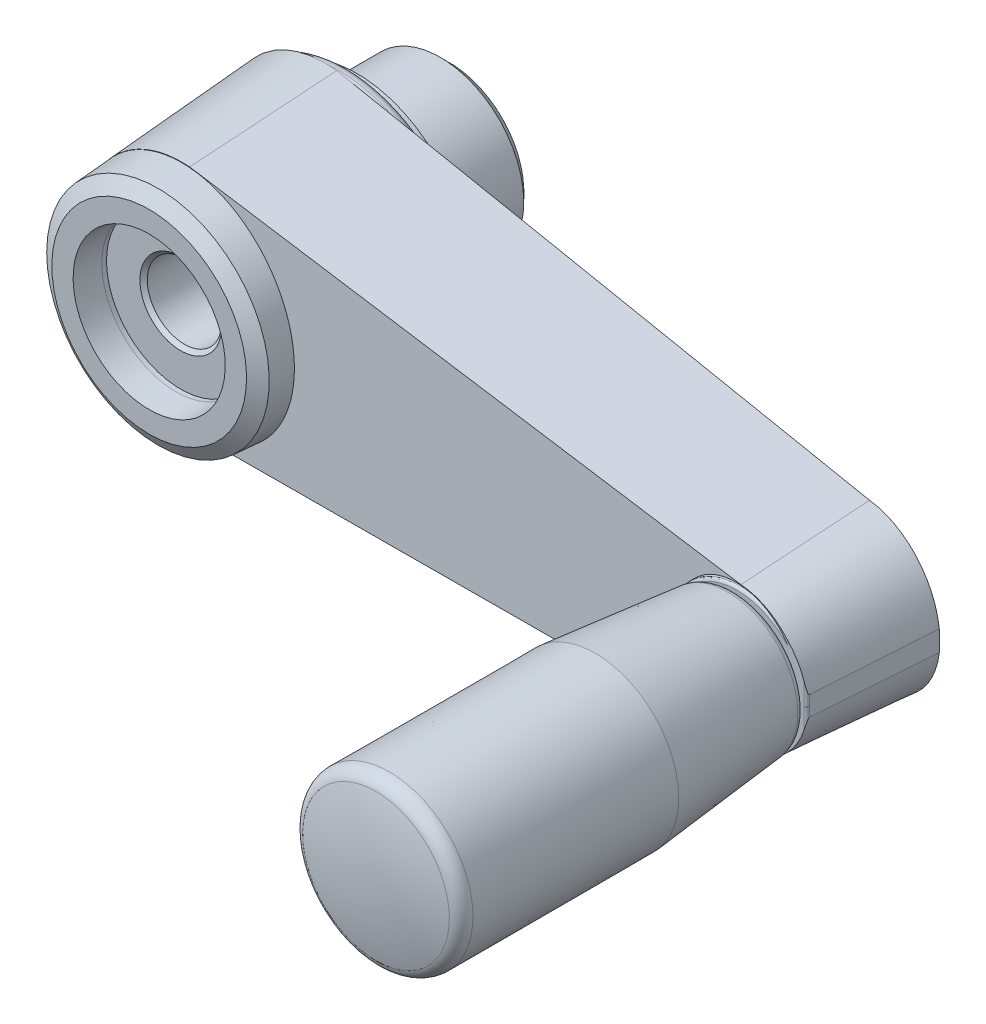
ISO-10303-21;
HEADER;
FILE_DESCRIPTION(('STEP AP214'),'2;1');
FILE_NAME('part.step','',(''),(''),'','','');
FILE_SCHEMA(('AUTOMOTIVE_DESIGN { 1 0 10303 214 1 1 1 1 }'));
ENDSEC;
DATA;
#1=APPLICATION_CONTEXT('core data for automotive mechanical design processes');
#2=APPLICATION_PROTOCOL_DEFINITION('international standard','automotive_design',2000,#1);
#3=PRODUCT_CONTEXT('',#1,'mechanical');
#4=PRODUCT('Part','Part','',(#3));
#5=PRODUCT_RELATED_PRODUCT_CATEGORY('part','',(#4));
#6=PRODUCT_DEFINITION_FORMATION('','',#4);
#7=PRODUCT_DEFINITION_CONTEXT('part definition',#1,'design');
#8=PRODUCT_DEFINITION('design','',#6,#7);
#9=PRODUCT_DEFINITION_SHAPE('','',#8);
#10=(LENGTH_UNIT() NAMED_UNIT(*) SI_UNIT(.MILLI.,.METRE.));
#11=(NAMED_UNIT(*) PLANE_ANGLE_UNIT() SI_UNIT($,.RADIAN.));
#12=(NAMED_UNIT(*) SI_UNIT($,.STERADIAN.) SOLID_ANGLE_UNIT());
#13=UNCERTAINTY_MEASURE_WITH_UNIT(LENGTH_MEASURE(1.E-05),#10,'distance_accuracy_value','');
#14=(GEOMETRIC_REPRESENTATION_CONTEXT(3) GLOBAL_UNCERTAINTY_ASSIGNED_CONTEXT((#13)) GLOBAL_UNIT_ASSIGNED_CONTEXT((#10,
#11,#12)) REPRESENTATION_CONTEXT('',''));
#15=CARTESIAN_POINT('',(0.,0.,0.));
#16=DIRECTION('',(0.,0.,1.));
#17=DIRECTION('',(1.,0.,0.));
#18=AXIS2_PLACEMENT_3D('',#15,#16,#17);
#19=CARTESIAN_POINT('',(-8.,0.,0.));
#20=DIRECTION('',(0.,0.,-1.));
#21=DIRECTION('',(0.,1.,0.));
#22=AXIS2_PLACEMENT_3D('',#19,#20,#21);
#23=PLANE('',#22);
#24=CARTESIAN_POINT('',(0.,0.,0.));
#25=DIRECTION('',(0.,0.,1.));
#26=DIRECTION('',(0.,-1.,0.));
#27=AXIS2_PLACEMENT_3D('',#24,#25,#26);
#28=CIRCLE('',#27,8.);
#29=CARTESIAN_POINT('',(0.,-8.,0.));
#30=VERTEX_POINT('',#29);
#31=EDGE_CURVE('E903',#30,#30,#28,.T.);
#32=ORIENTED_EDGE('',*,*,#31,.F.);
#33=EDGE_LOOP('',(#32));
#34=FACE_BOUND('',#33,.T.);
#35=CARTESIAN_POINT('',(0.,0.,0.));
#36=DIRECTION('',(0.,0.,-1.));
#37=DIRECTION('',(0.,1.,0.));
#38=AXIS2_PLACEMENT_3D('',#35,#36,#37);
#39=CIRCLE('',#38,4.4);
#40=CARTESIAN_POINT('',(0.,4.4,0.));
#41=VERTEX_POINT('',#40);
#42=EDGE_CURVE('E882',#41,#41,#39,.T.);
#43=ORIENTED_EDGE('',*,*,#42,.F.);
#44=EDGE_LOOP('',(#43));
#45=FACE_BOUND('',#44,.T.);
#46=ADVANCED_FACE('F14',(#34,#45),#23,.T.);
#47=CARTESIAN_POINT('',(-13.440363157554,-13.5,10.8528465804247));
#48=DIRECTION('',(-0.101635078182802,0.,0.994821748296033));
#49=DIRECTION('',(-0.994821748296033,0.,-0.101635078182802));
#50=AXIS2_PLACEMENT_3D('',#47,#48,#49);
#51=PLANE('',#50);
#52=DIRECTION('',(-0.991996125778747,0.0753166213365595,-0.101346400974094));
#53=VECTOR('',#52,1.);
#54=CARTESIAN_POINT('',(-11.3537333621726,14.2698803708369,11.0660252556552));
#55=LINE('',#54,#53);
#56=CARTESIAN_POINT('',(0.0563315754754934,13.4035790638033,12.2317243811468));
#57=VERTEX_POINT('',#56);
#58=CARTESIAN_POINT('',(64.0540917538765,8.54459328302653,18.7699985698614));
#59=VERTEX_POINT('',#58);
#60=EDGE_CURVE('E139',#57,#59,#55,.F.);
#61=ORIENTED_EDGE('',*,*,#60,.T.);
#62=CARTESIAN_POINT('',(64.0121037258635,0.0482350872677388,18.7657089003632));
#63=DIRECTION('',(-0.101635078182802,0.,0.994821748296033));
#64=DIRECTION('',(-0.994821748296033,0.,-0.101635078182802));
#65=AXIS2_PLACEMENT_3D('',#62,#63,#64);
#66=ELLIPSE('',#65,8.54090572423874,8.49646193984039);
#67=CARTESIAN_POINT('',(72.4351840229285,1.16412252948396,19.6262453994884));
#68=VERTEX_POINT('',#67);
#69=EDGE_CURVE('E585',#59,#68,#66,.F.);
#70=ORIENTED_EDGE('',*,*,#69,.T.);
#71=DIRECTION('',(0.,1.,0.));
#72=VECTOR('',#71,1.);
#73=CARTESIAN_POINT('',(72.4351840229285,-13.5,19.6262453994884));
#74=LINE('',#73,#72);
#75=CARTESIAN_POINT('',(72.4351840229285,-1.06765235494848,19.6262453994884));
#76=VERTEX_POINT('',#75);
#77=EDGE_CURVE('E578',#76,#68,#74,.T.);
#78=ORIENTED_EDGE('',*,*,#77,.F.);
#79=CARTESIAN_POINT('',(64.0536827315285,-8.44812511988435,18.7699567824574));
#80=VERTEX_POINT('',#79);
#81=EDGE_CURVE('E583',#76,#80,#66,.F.);
#82=ORIENTED_EDGE('',*,*,#81,.T.);
#83=DIRECTION('',(0.991883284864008,0.0768035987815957,0.101334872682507));
#84=VECTOR('',#83,1.);
#85=CARTESIAN_POINT('',(-13.3680947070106,-14.443055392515,10.8602298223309));
#86=LINE('',#85,#84);
#87=CARTESIAN_POINT('',(0.0562593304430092,-13.4035795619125,12.2317170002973));
#88=VERTEX_POINT('',#87);
#89=EDGE_CURVE('E564',#88,#80,#86,.T.);
#90=ORIENTED_EDGE('',*,*,#89,.F.);
#91=CARTESIAN_POINT('',(-0.0361231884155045,0.,12.2222788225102));
#92=DIRECTION('',(-0.101635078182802,0.,0.994821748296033));
#93=DIRECTION('',(-0.994821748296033,0.,-0.101635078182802));
#94=AXIS2_PLACEMENT_3D('',#91,#92,#93);
#95=ELLIPSE('',#94,13.4740117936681,13.4038979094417);
#96=EDGE_CURVE('E570',#88,#57,#95,.F.);
#97=ORIENTED_EDGE('',*,*,#96,.T.);
#98=EDGE_LOOP('',(#61,#70,#78,#82,#90,#97));
#99=FACE_BOUND('',#98,.T.);
#100=CARTESIAN_POINT('',(-12.25827662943,0.,10.9736133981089));
#101=CARTESIAN_POINT('',(-12.2603653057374,-0.0230566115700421,10.9734000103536));
#102=CARTESIAN_POINT('',(-12.2623895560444,-0.0461199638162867,10.9731932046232));
#103=CARTESIAN_POINT('',(-12.2926645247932,-0.402499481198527,10.970100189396));
#104=CARTESIAN_POINT('',(-12.3075262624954,-0.737123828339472,10.9685818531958));
#105=CARTESIAN_POINT('',(-12.3102035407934,-1.40673069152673,10.9683083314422));
#106=CARTESIAN_POINT('',(-12.2979863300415,-1.74171315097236,10.9695564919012));
#107=CARTESIAN_POINT('',(-12.219987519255,-2.75190885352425,10.9775251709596));
#108=CARTESIAN_POINT('',(-12.112172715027,-3.42433720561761,10.9885399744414));
#109=CARTESIAN_POINT('',(-11.7874638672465,-4.7429205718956,11.0217135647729));
#110=CARTESIAN_POINT('',(-11.5704350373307,-5.38904205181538,11.0438861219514));
#111=CARTESIAN_POINT('',(-11.165304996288,-6.32971819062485,11.08527587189));
#112=CARTESIAN_POINT('',(-11.0152108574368,-6.64129492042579,11.1006101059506));
#113=CARTESIAN_POINT('',(-10.6892883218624,-7.25065033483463,11.1339076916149));
#114=CARTESIAN_POINT('',(-10.5134589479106,-7.54842849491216,11.1518711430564));
#115=CARTESIAN_POINT('',(-10.1373543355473,-8.12784709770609,11.1902955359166));
#116=CARTESIAN_POINT('',(-9.93708382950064,-8.40949064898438,11.2107559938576));
#117=CARTESIAN_POINT('',(-9.51346910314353,-8.95466184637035,11.2540342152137));
#118=CARTESIAN_POINT('',(-9.29012538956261,-9.21818989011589,11.2768519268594));
#119=CARTESIAN_POINT('',(-8.82338015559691,-9.72362124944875,11.3245365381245));
#120=CARTESIAN_POINT('',(-8.58011061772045,-9.96564773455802,11.3493899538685));
#121=CARTESIAN_POINT('',(-8.07403834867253,-10.4281061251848,11.4010923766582));
#122=CARTESIAN_POINT('',(-7.81123562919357,-10.6485380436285,11.4279413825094));
#123=CARTESIAN_POINT('',(-7.2679646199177,-11.0661539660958,11.4834441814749));
#124=CARTESIAN_POINT('',(-6.98749725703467,-11.2633391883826,11.5120978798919));
#125=CARTESIAN_POINT('',(-6.41087496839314,-11.6329844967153,11.5710079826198));
#126=CARTESIAN_POINT('',(-6.11472013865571,-11.8054447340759,11.6012643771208));
#127=CARTESIAN_POINT('',(-5.5112492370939,-12.1230425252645,11.6629174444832));
#128=CARTESIAN_POINT('',(-5.20404064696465,-12.2683864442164,11.6943031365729));
#129=CARTESIAN_POINT('',(-4.57844231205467,-12.5322992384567,11.7582168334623));
#130=CARTESIAN_POINT('',(-4.26005261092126,-12.6508682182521,11.7907448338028));
#131=CARTESIAN_POINT('',(-3.61439648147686,-12.8602563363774,11.8567077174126));
#132=CARTESIAN_POINT('',(-3.28713086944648,-12.9510780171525,11.8901425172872));
#133=CARTESIAN_POINT('',(-2.62606177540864,-13.1041926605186,11.9576800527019));
#134=CARTESIAN_POINT('',(-2.29225842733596,-13.1664862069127,11.9917827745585));
#135=CARTESIAN_POINT('',(-1.62491743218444,-13.2613076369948,12.0599610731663));
#136=CARTESIAN_POINT('',(-1.29143270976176,-13.2942118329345,12.094031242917));
#137=CARTESIAN_POINT('',(-0.622897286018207,-13.3311976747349,12.1623315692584));
#138=CARTESIAN_POINT('',(-0.28784667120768,-13.3352808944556,12.1965617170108));
#139=CARTESIAN_POINT('',(0.381867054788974,-13.314329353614,12.2649824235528));
#140=CARTESIAN_POINT('',(0.716528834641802,-13.2892509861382,12.2991728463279));
#141=CARTESIAN_POINT('',(1.38246825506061,-13.2097781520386,12.367207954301));
#142=CARTESIAN_POINT('',(1.71374502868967,-13.155376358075,12.4010525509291));
#143=CARTESIAN_POINT('',(2.04199818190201,-13.0862557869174,12.4345882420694));
#144=B_SPLINE_CURVE_WITH_KNOTS('',3,(#100,#101,#102,#103,#104,#105,#106,#107,#108,#109,#110,
#111,#112,#113,#114,#115,#116,#117,#118,#119,#120,#121,#122,#123,#124,#125,#126,#127,#128,#129,
#130,#131,#132,#133,#134,#135,#136,#137,#138,#139,#140,#141,#142,#143),.UNSPECIFIED.,.F.,.F.,(4,
2,2,2,2,2,2,2,2,2,2,2,2,2,2,2,2,2,2,2,2,4),(0.,0.0694583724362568,1.072991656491,
2.07773935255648,4.11113551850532,6.14704737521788,7.18455420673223,8.22210044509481,
9.25944610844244,10.2967689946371,11.3277041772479,12.3586387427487,13.3895192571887,
14.4203934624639,15.4430701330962,16.4657428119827,17.4883217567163,18.5108797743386,
19.520148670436,20.5293624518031,21.5400873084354,22.5510648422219),.UNSPECIFIED.);
#145=CARTESIAN_POINT('',(-12.25827662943,0.,10.9736133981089));
#146=VERTEX_POINT('',#145);
#147=CARTESIAN_POINT('',(-1.8380006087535,-13.23041618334,12.038191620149));
#148=VERTEX_POINT('',#147);
#149=EDGE_CURVE('E23',#146,#148,#144,.T.);
#150=ORIENTED_EDGE('',*,*,#149,.T.);
#151=CARTESIAN_POINT('',(-0.0953370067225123,0.,12.2162292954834));
#152=DIRECTION('',(-0.101635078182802,0.,0.994821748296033));
#153=DIRECTION('',(-0.994821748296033,0.,-0.101635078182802));
#154=AXIS2_PLACEMENT_3D('',#151,#152,#153);
#155=ELLIPSE('',#154,13.414489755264,13.3446856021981);
#156=CARTESIAN_POINT('',(-1.8380006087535,13.23041618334,12.038191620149));
#157=VERTEX_POINT('',#156);
#158=EDGE_CURVE('E9',#148,#157,#155,.T.);
#159=ORIENTED_EDGE('',*,*,#158,.T.);
#160=CARTESIAN_POINT('',(-12.25827662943,0.,10.9736133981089));
#161=CARTESIAN_POINT('',(-12.2603653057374,0.0230566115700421,10.9734000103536));
#162=CARTESIAN_POINT('',(-12.2623895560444,0.0461199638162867,10.9731932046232));
#163=CARTESIAN_POINT('',(-12.2926645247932,0.402499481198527,10.970100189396));
#164=CARTESIAN_POINT('',(-12.3075262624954,0.737123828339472,10.9685818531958));
#165=CARTESIAN_POINT('',(-12.3102035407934,1.40673069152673,10.9683083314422));
#166=CARTESIAN_POINT('',(-12.2979863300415,1.74171315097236,10.9695564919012));
#167=CARTESIAN_POINT('',(-12.219987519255,2.75190885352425,10.9775251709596));
#168=CARTESIAN_POINT('',(-12.112172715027,3.42433720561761,10.9885399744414));
#169=CARTESIAN_POINT('',(-11.7874638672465,4.7429205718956,11.0217135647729));
#170=CARTESIAN_POINT('',(-11.5704350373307,5.38904205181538,11.0438861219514));
#171=CARTESIAN_POINT('',(-11.165304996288,6.32971819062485,11.08527587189));
#172=CARTESIAN_POINT('',(-11.0152108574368,6.64129492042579,11.1006101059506));
#173=CARTESIAN_POINT('',(-10.6892883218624,7.25065033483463,11.1339076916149));
#174=CARTESIAN_POINT('',(-10.5134589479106,7.54842849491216,11.1518711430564));
#175=CARTESIAN_POINT('',(-10.1373543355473,8.12784709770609,11.1902955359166));
#176=CARTESIAN_POINT('',(-9.93708382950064,8.40949064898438,11.2107559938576));
#177=CARTESIAN_POINT('',(-9.51346910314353,8.95466184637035,11.2540342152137));
#178=CARTESIAN_POINT('',(-9.29012538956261,9.21818989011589,11.2768519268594));
#179=CARTESIAN_POINT('',(-8.82338015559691,9.72362124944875,11.3245365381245));
#180=CARTESIAN_POINT('',(-8.58011061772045,9.96564773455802,11.3493899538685));
#181=CARTESIAN_POINT('',(-8.07403834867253,10.4281061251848,11.4010923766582));
#182=CARTESIAN_POINT('',(-7.81123562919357,10.6485380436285,11.4279413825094));
#183=CARTESIAN_POINT('',(-7.2679646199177,11.0661539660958,11.4834441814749));
#184=CARTESIAN_POINT('',(-6.98749725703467,11.2633391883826,11.5120978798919));
#185=CARTESIAN_POINT('',(-6.41087496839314,11.6329844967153,11.5710079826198));
#186=CARTESIAN_POINT('',(-6.11472013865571,11.8054447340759,11.6012643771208));
#187=CARTESIAN_POINT('',(-5.5112492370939,12.1230425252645,11.6629174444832));
#188=CARTESIAN_POINT('',(-5.20404064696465,12.2683864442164,11.6943031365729));
#189=CARTESIAN_POINT('',(-4.57844231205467,12.5322992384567,11.7582168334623));
#190=CARTESIAN_POINT('',(-4.26005261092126,12.6508682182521,11.7907448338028));
#191=CARTESIAN_POINT('',(-3.61439648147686,12.8602563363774,11.8567077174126));
#192=CARTESIAN_POINT('',(-3.28713086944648,12.9510780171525,11.8901425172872));
#193=CARTESIAN_POINT('',(-2.62606177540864,13.1041926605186,11.9576800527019));
#194=CARTESIAN_POINT('',(-2.29225842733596,13.1664862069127,11.9917827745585));
#195=CARTESIAN_POINT('',(-1.62491743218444,13.2613076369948,12.0599610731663));
#196=CARTESIAN_POINT('',(-1.29143270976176,13.2942118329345,12.094031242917));
#197=CARTESIAN_POINT('',(-0.622897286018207,13.3311976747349,12.1623315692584));
#198=CARTESIAN_POINT('',(-0.28784667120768,13.3352808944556,12.1965617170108));
#199=CARTESIAN_POINT('',(0.381867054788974,13.314329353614,12.2649824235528));
#200=CARTESIAN_POINT('',(0.716528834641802,13.2892509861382,12.2991728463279));
#201=CARTESIAN_POINT('',(1.38246825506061,13.2097781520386,12.367207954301));
#202=CARTESIAN_POINT('',(1.71374502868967,13.155376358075,12.4010525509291));
#203=CARTESIAN_POINT('',(2.04199818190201,13.0862557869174,12.4345882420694));
#204=B_SPLINE_CURVE_WITH_KNOTS('',3,(#160,#161,#162,#163,#164,#165,#166,#167,#168,#169,#170,
#171,#172,#173,#174,#175,#176,#177,#178,#179,#180,#181,#182,#183,#184,#185,#186,#187,#188,#189,
#190,#191,#192,#193,#194,#195,#196,#197,#198,#199,#200,#201,#202,#203),.UNSPECIFIED.,.F.,.F.,(4,
2,2,2,2,2,2,2,2,2,2,2,2,2,2,2,2,2,2,2,2,4),(0.,0.0694583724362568,1.072991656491,
2.07773935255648,4.11113551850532,6.14704737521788,7.18455420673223,8.22210044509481,
9.25944610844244,10.2967689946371,11.3277041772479,12.3586387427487,13.3895192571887,
14.4203934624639,15.4430701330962,16.4657428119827,17.4883217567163,18.5108797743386,
19.520148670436,20.5293624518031,21.5400873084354,22.5510648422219),.UNSPECIFIED.);
#205=EDGE_CURVE('E133',#157,#146,#204,.F.);
#206=ORIENTED_EDGE('',*,*,#205,.T.);
#207=EDGE_LOOP('',(#150,#159,#206));
#208=FACE_BOUND('',#207,.T.);
#209=ADVANCED_FACE('F339',(#99,#208),#51,.F.);
#210=CARTESIAN_POINT('',(-12.298923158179,-13.5,27.1761990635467));
#211=DIRECTION('',(-0.0710755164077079,0.,0.997470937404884));
#212=DIRECTION('',(-0.997470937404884,0.,-0.0710755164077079));
#213=AXIS2_PLACEMENT_3D('',#210,#211,#212);
#214=PLANE('',#213);
#215=DIRECTION('',(0.,1.,0.));
#216=VECTOR('',#215,1.);
#217=CARTESIAN_POINT('',(69.4320648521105,-13.5,33.));
#218=LINE('',#217,#216);
#219=CARTESIAN_POINT('',(69.43206485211,-5.20039600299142,33.));
#220=VERTEX_POINT('',#219);
#221=CARTESIAN_POINT('',(69.4320648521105,-4.75675673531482,33.));
#222=VERTEX_POINT('',#221);
#223=EDGE_CURVE('E507',#220,#222,#218,.T.);
#224=ORIENTED_EDGE('',*,*,#223,.T.);
#225=CARTESIAN_POINT('',(65.5127570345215,-6.75365647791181,32.7207268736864));
#226=CARTESIAN_POINT('',(65.7078611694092,-6.71097983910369,32.7346291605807));
#227=CARTESIAN_POINT('',(65.9013114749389,-6.66074034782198,32.7484136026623));
#228=CARTESIAN_POINT('',(66.2843628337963,-6.54539543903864,32.775708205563));
#229=CARTESIAN_POINT('',(66.4739511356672,-6.48024744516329,32.7892174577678));
#230=CARTESIAN_POINT('',(66.8476131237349,-6.33559020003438,32.8158430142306));
#231=CARTESIAN_POINT('',(67.0316862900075,-6.2560795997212,32.8289592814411));
#232=CARTESIAN_POINT('',(67.393261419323,-6.08340899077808,32.8547235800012));
#233=CARTESIAN_POINT('',(67.5707655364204,-5.99025350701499,32.8673717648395));
#234=CARTESIAN_POINT('',(67.9184940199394,-5.79117793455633,32.8921494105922));
#235=CARTESIAN_POINT('',(68.0887185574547,-5.68525814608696,32.9042788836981));
#236=CARTESIAN_POINT('',(68.3367910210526,-5.51899362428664,32.9219554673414));
#237=CARTESIAN_POINT('',(68.417525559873,-5.46291694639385,32.9277082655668));
#238=CARTESIAN_POINT('',(68.5373290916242,-5.37699854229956,32.936244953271));
#239=CARTESIAN_POINT('',(68.5770441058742,-5.34806089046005,32.9390748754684));
#240=CARTESIAN_POINT('',(68.6560690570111,-5.2896368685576,32.9447058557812));
#241=CARTESIAN_POINT('',(68.6953790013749,-5.26015050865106,32.9475069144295));
#242=CARTESIAN_POINT('',(68.7807606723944,-5.19528466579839,32.9535908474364));
#243=CARTESIAN_POINT('',(68.8267602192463,-5.15980980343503,32.9568685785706));
#244=CARTESIAN_POINT('',(68.9183877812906,-5.08836798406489,32.9633975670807));
#245=CARTESIAN_POINT('',(68.9640157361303,-5.05240094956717,32.9666488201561));
#246=CARTESIAN_POINT('',(69.0550996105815,-4.98032380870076,32.9731390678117));
#247=CARTESIAN_POINT('',(69.1005556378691,-4.94421383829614,32.9763780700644));
#248=CARTESIAN_POINT('',(69.1691235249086,-4.8905522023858,32.9812639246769));
#249=CARTESIAN_POINT('',(69.1920393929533,-4.87275196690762,32.9828968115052));
#250=CARTESIAN_POINT('',(69.2382164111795,-4.83761101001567,32.986187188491));
#251=CARTESIAN_POINT('',(69.2614775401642,-4.82027026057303,32.9878446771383));
#252=CARTESIAN_POINT('',(69.3067062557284,-4.78809498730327,32.9910674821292));
#253=CARTESIAN_POINT('',(69.3286097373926,-4.77317378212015,32.9926282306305));
#254=CARTESIAN_POINT('',(69.3623924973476,-4.75339919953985,32.9950354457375));
#255=CARTESIAN_POINT('',(69.3735232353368,-4.7473617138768,32.9958285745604));
#256=CARTESIAN_POINT('',(69.3898974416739,-4.74051096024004,32.9969953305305));
#257=CARTESIAN_POINT('',(69.394698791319,-4.73872789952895,32.9973374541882));
#258=CARTESIAN_POINT('',(69.402116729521,-4.7366941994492,32.9978660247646));
#259=CARTESIAN_POINT('',(69.4046427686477,-4.73612150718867,32.9980460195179));
#260=CARTESIAN_POINT('',(69.4097503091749,-4.73534831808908,32.9984099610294));
#261=CARTESIAN_POINT('',(69.4123313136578,-4.73514530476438,32.9985938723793));
#262=CARTESIAN_POINT('',(69.4158692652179,-4.73532939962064,32.9988459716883));
#263=CARTESIAN_POINT('',(69.4168387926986,-4.73542820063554,32.9989150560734));
#264=CARTESIAN_POINT('',(69.4187584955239,-4.73575026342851,32.999051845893));
#265=CARTESIAN_POINT('',(69.4197086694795,-4.73597353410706,32.9991195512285));
#266=CARTESIAN_POINT('',(69.4215753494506,-4.73657546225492,32.9992525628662));
#267=CARTESIAN_POINT('',(69.4224912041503,-4.73695623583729,32.9993178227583));
#268=CARTESIAN_POINT('',(69.4242299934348,-4.7378907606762,32.9994417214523));
#269=CARTESIAN_POINT('',(69.4250531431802,-4.73844409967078,32.9995003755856));
#270=CARTESIAN_POINT('',(69.4264712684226,-4.73963496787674,32.9996014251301));
#271=CARTESIAN_POINT('',(69.4270818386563,-4.74025391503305,32.9996449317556));
#272=CARTESIAN_POINT('',(69.4281834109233,-4.74159107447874,32.999723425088));
#273=CARTESIAN_POINT('',(69.4286742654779,-4.742309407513,32.999758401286));
#274=CARTESIAN_POINT('',(69.4296563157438,-4.74402085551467,32.9998283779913));
#275=CARTESIAN_POINT('',(69.4301103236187,-4.74503513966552,32.9998607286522));
#276=CARTESIAN_POINT('',(69.4308544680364,-4.74712184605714,32.9999137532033));
#277=CARTESIAN_POINT('',(69.4311442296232,-4.74819439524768,32.9999344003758));
#278=CARTESIAN_POINT('',(69.4317798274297,-4.75125139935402,32.9999796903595));
#279=CARTESIAN_POINT('',(69.4319783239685,-4.75326548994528,32.9999938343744));
#280=CARTESIAN_POINT('',(69.4321037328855,-4.75730082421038,33.0000027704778));
#281=CARTESIAN_POINT('',(69.432029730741,-4.75932206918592,32.9999974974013));
#282=CARTESIAN_POINT('',(69.4313384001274,-4.76809209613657,32.9999482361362));
#283=CARTESIAN_POINT('',(69.4298516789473,-4.77475753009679,32.9998422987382));
#284=CARTESIAN_POINT('',(69.4261672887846,-4.78788266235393,32.99957976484));
#285=CARTESIAN_POINT('',(69.4239646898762,-4.79434058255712,32.9994228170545));
#286=CARTESIAN_POINT('',(69.4159010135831,-4.81576995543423,32.9988482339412));
#287=CARTESIAN_POINT('',(69.4091316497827,-4.83040119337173,32.9983658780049));
#288=CARTESIAN_POINT('',(69.3946969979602,-4.85921784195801,32.997337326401));
#289=CARTESIAN_POINT('',(69.3870292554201,-4.87340189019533,32.9967909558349));
#290=CARTESIAN_POINT('',(69.3631980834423,-4.91543949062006,32.9950928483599));
#291=CARTESIAN_POINT('',(69.3461897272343,-4.9428150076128,32.99388090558));
#292=CARTESIAN_POINT('',(69.2935970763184,-5.02350057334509,32.9901333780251));
#293=CARTESIAN_POINT('',(69.2562927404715,-5.0756545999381,32.987475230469));
#294=CARTESIAN_POINT('',(69.1789628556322,-5.17797264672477,32.9819650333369));
#295=CARTESIAN_POINT('',(69.1389336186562,-5.22813381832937,32.9791127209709));
#296=CARTESIAN_POINT('',(69.0567703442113,-5.32669563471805,32.9732581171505));
#297=CARTESIAN_POINT('',(69.01463616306,-5.37509615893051,32.9702558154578));
#298=CARTESIAN_POINT('',(68.9286086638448,-5.47024588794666,32.9641258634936));
#299=CARTESIAN_POINT('',(68.8847162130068,-5.51699588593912,32.9609982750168));
#300=CARTESIAN_POINT('',(68.7185162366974,-5.68799361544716,32.9491555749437));
#301=CARTESIAN_POINT('',(68.5911106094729,-5.80731905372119,32.940077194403));
#302=CARTESIAN_POINT('',(68.3266303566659,-6.03482061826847,32.9212314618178));
#303=CARTESIAN_POINT('',(68.1895463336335,-6.14298565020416,32.9114634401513));
#304=CARTESIAN_POINT('',(67.9067762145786,-6.34801831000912,32.8913144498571));
#305=CARTESIAN_POINT('',(67.7610732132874,-6.44486254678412,32.8809322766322));
#306=CARTESIAN_POINT('',(67.462560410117,-6.62657788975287,32.8596615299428));
#307=CARTESIAN_POINT('',(67.3097537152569,-6.71145416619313,32.8487731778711));
#308=CARTESIAN_POINT('',(66.8937333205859,-6.92153217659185,32.8191293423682));
#309=CARTESIAN_POINT('',(66.6249029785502,-7.03583707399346,32.7999736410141));
#310=CARTESIAN_POINT('',(66.2131472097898,-7.18010379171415,32.7706336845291));
#311=CARTESIAN_POINT('',(66.0747596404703,-7.22360143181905,32.7607727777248));
#312=CARTESIAN_POINT('',(65.7955053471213,-7.30153622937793,32.7408743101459));
#313=CARTESIAN_POINT('',(65.6546392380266,-7.3359756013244,32.730836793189));
#314=CARTESIAN_POINT('',(65.512757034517,-7.36583101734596,32.7207268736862));
#315=B_SPLINE_CURVE_WITH_KNOTS('',3,(#225,#226,#227,#228,#229,#230,#231,#232,#233,#234,#235,
#236,#237,#238,#239,#240,#241,#242,#243,#244,#245,#246,#247,#248,#249,#250,#251,#252,#253,#254,
#255,#256,#257,#258,#259,#260,#261,#262,#263,#264,#265,#266,#267,#268,#269,#270,#271,#272,#273,
#274,#275,#276,#277,#278,#279,#280,#281,#282,#283,#284,#285,#286,#287,#288,#289,#290,#291,#292,
#293,#294,#295,#296,#297,#298,#299,#300,#301,#302,#303,#304,#305,#306,#307,#308,#309,#310,#311,
#312,#313,#314),.UNSPECIFIED.,.F.,.F.,(4,2,2,2,2,2,2,2,2,2,2,2,2,2,2,2,2,2,2,2,2,2,2,2,2,2,2,2,
2,2,2,2,2,2,2,2,2,2,2,2,2,2,2,2,4),(0.,0.600442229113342,1.20262111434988,1.80485659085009,
2.40689280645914,3.00891486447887,3.30427619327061,3.45193329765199,3.59958767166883,
3.77412925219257,3.94869863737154,4.12312968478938,4.21031451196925,4.29749400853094,
4.37707057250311,4.41502883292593,4.43037881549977,4.43815720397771,4.44588244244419,
4.44880729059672,4.451732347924,4.45469805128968,4.45765672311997,4.46025342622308,
4.46285331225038,4.46616971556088,4.46949365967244,4.47553119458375,4.48158901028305,
4.50192160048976,4.52239728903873,4.57066109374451,4.61905998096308,4.71573725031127,
4.90812660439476,5.10078173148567,5.29345002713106,5.48602443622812,6.0096261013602,
6.53374335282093,7.0589250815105,7.58387922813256,8.45921814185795,8.89516243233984,
9.33100004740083),.UNSPECIFIED.);
#316=CARTESIAN_POINT('',(66.855872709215,-6.9315268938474,32.8164315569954));
#317=VERTEX_POINT('',#316);
#318=EDGE_CURVE('E201',#222,#317,#315,.T.);
#319=ORIENTED_EDGE('',*,*,#318,.T.);
#320=CARTESIAN_POINT('',(64.0352933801,0.0482350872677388,32.615449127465));
#321=DIRECTION('',(-0.0710755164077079,0.,0.997470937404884));
#322=DIRECTION('',(-0.997470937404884,0.,-0.0710755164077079));
#323=AXIS2_PLACEMENT_3D('',#320,#321,#322);
#324=ELLIPSE('',#323,7.5472981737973,7.52811713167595);
#325=EDGE_CURVE('E584',#220,#317,#324,.F.);
#326=ORIENTED_EDGE('',*,*,#325,.F.);
#327=EDGE_LOOP('',(#224,#319,#326));
#328=FACE_BOUND('',#327,.T.);
#329=ADVANCED_FACE('F345',(#328),#214,.T.);
#330=CARTESIAN_POINT('',(71.2202454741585,-13.5,32.7));
#331=DIRECTION('',(0.,1.,0.));
#332=DIRECTION('',(-1.,0.,0.));
#333=AXIS2_PLACEMENT_3D('',#330,#331,#332);
#334=CYLINDRICAL_SURFACE('',#333,0.300000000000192);
#335=CARTESIAN_POINT('',(71.2202454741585,-0.0530649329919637,32.9999999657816));
#336=CARTESIAN_POINT('',(71.2337523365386,-0.0530616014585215,33.0000082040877));
#337=CARTESIAN_POINT('',(71.247262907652,-0.0530950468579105,32.9990891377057));
#338=CARTESIAN_POINT('',(71.2773548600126,-0.0532061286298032,32.9949925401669));
#339=CARTESIAN_POINT('',(71.293869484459,-0.0532926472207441,32.9913127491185));
#340=CARTESIAN_POINT('',(71.3260638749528,-0.0534348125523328,32.9812258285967));
#341=CARTESIAN_POINT('',(71.3417426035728,-0.0534904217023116,32.9748153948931));
#342=CARTESIAN_POINT('',(71.3717933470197,-0.0536013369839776,32.9594564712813));
#343=CARTESIAN_POINT('',(71.386166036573,-0.0536566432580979,32.9505093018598));
#344=CARTESIAN_POINT('',(71.4132026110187,-0.0537586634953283,32.9303303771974));
#345=CARTESIAN_POINT('',(71.4258667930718,-0.0538053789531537,32.9190990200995));
#346=CARTESIAN_POINT('',(71.4491318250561,-0.0538913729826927,32.8946679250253));
#347=CARTESIAN_POINT('',(71.4597323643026,-0.0539306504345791,32.8814678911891));
#348=CARTESIAN_POINT('',(71.4785656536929,-0.0540003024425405,32.8534770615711));
#349=CARTESIAN_POINT('',(71.4867986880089,-0.0540306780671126,32.8386864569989));
#350=CARTESIAN_POINT('',(71.5006643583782,-0.0540819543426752,32.8079337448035));
#351=CARTESIAN_POINT('',(71.5062971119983,-0.0541028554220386,32.791971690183));
#352=CARTESIAN_POINT('',(71.5148049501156,-0.0541346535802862,32.7593251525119));
#353=CARTESIAN_POINT('',(71.517679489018,-0.0541455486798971,32.7426405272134));
#354=CARTESIAN_POINT('',(71.5205821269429,-0.0541570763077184,32.7090337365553));
#355=CARTESIAN_POINT('',(71.5206115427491,-0.0541577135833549,32.6921116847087));
#356=CARTESIAN_POINT('',(71.5178423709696,-0.0541488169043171,32.6584889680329));
#357=CARTESIAN_POINT('',(71.5150417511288,-0.0541392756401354,32.6417884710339));
#358=CARTESIAN_POINT('',(71.510833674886,-0.0541246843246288,32.6254446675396));
#359=B_SPLINE_CURVE_WITH_KNOTS('',3,(#335,#336,#337,#338,#339,#340,#341,#342,#343,#344,#345,
#346,#347,#348,#349,#350,#351,#352,#353,#354,#355,#356,#357,#358),.UNSPECIFIED.,.F.,.F.,(4,2,2,
2,2,2,2,2,2,2,2,4),(0.,0.040500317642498,0.0910152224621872,0.141591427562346,0.19214135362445,
0.2426824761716,0.293231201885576,0.343773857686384,0.394314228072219,0.444864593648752,
0.495391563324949,0.545954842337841),.UNSPECIFIED.);
#360=CARTESIAN_POINT('',(71.2202454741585,-0.0530649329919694,33.));
#361=VERTEX_POINT('',#360);
#362=CARTESIAN_POINT('',(71.5195146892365,-0.0541528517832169,32.720926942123));
#363=VERTEX_POINT('',#362);
#364=EDGE_CURVE('E202',#361,#363,#359,.T.);
#365=ORIENTED_EDGE('',*,*,#364,.F.);
#366=DIRECTION('',(0.,1.,0.));
#367=VECTOR('',#366,1.);
#368=CARTESIAN_POINT('',(71.2202454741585,-13.5,33.));
#369=LINE('',#368,#367);
#370=CARTESIAN_POINT('',(71.2202454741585,-2.22857976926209,33.));
#371=VERTEX_POINT('',#370);
#372=EDGE_CURVE('E502',#371,#361,#369,.T.);
#373=ORIENTED_EDGE('',*,*,#372,.F.);
#374=CARTESIAN_POINT('',(71.2200454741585,-2.22920753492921,32.9999999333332));
#375=CARTESIAN_POINT('',(71.2352226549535,-2.18158273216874,32.9999909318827));
#376=CARTESIAN_POINT('',(71.2499931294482,-2.13383862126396,32.998868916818));
#377=CARTESIAN_POINT('',(71.2786907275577,-2.03818333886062,32.9946140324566));
#378=CARTESIAN_POINT('',(71.2926178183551,-1.99027216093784,32.9914810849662));
#379=CARTESIAN_POINT('',(71.3197410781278,-1.89384767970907,32.9833766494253));
#380=CARTESIAN_POINT('',(71.3329278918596,-1.84533339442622,32.978385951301));
#381=CARTESIAN_POINT('',(71.3583937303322,-1.74828290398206,32.9666681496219));
#382=CARTESIAN_POINT('',(71.3706728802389,-1.69974670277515,32.9599412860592));
#383=CARTESIAN_POINT('',(71.3922495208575,-1.61122686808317,32.9460667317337));
#384=CARTESIAN_POINT('',(71.4016925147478,-1.57123448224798,32.9391991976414));
#385=CARTESIAN_POINT('',(71.4199669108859,-1.49133066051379,32.924169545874));
#386=CARTESIAN_POINT('',(71.4287980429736,-1.45141926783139,32.9160068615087));
#387=CARTESIAN_POINT('',(71.4458171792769,-1.37198087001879,32.8981623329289));
#388=CARTESIAN_POINT('',(71.4540076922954,-1.33245295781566,32.8884869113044));
#389=CARTESIAN_POINT('',(71.4697982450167,-1.25385637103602,32.8670501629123));
#390=CARTESIAN_POINT('',(71.4773988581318,-1.21478728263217,32.8552908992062));
#391=CARTESIAN_POINT('',(71.486945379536,-1.16465906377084,32.8374507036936));
#392=CARTESIAN_POINT('',(71.4891431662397,-1.15304106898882,32.8331182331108));
#393=CARTESIAN_POINT('',(71.4934880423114,-1.12999933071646,32.8239497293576));
#394=CARTESIAN_POINT('',(71.4956350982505,-1.1185757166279,32.8191133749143));
#395=CARTESIAN_POINT('',(71.501444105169,-1.08765517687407,32.8050108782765));
#396=CARTESIAN_POINT('',(71.5050618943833,-1.06838355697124,32.7950978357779));
#397=CARTESIAN_POINT('',(71.50945104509,-1.04599720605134,32.7798104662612));
#398=CARTESIAN_POINT('',(71.5103413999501,-1.04151039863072,32.7765311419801));
#399=CARTESIAN_POINT('',(71.5120965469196,-1.0328661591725,32.7695431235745));
#400=CARTESIAN_POINT('',(71.5129613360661,-1.02870876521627,32.7658343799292));
#401=CARTESIAN_POINT('',(71.5143953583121,-1.0221004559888,32.759025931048));
#402=CARTESIAN_POINT('',(71.5149766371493,-1.01950752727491,32.7560684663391));
#403=CARTESIAN_POINT('',(71.5160982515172,-1.01475945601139,32.7498117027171));
#404=CARTESIAN_POINT('',(71.5166386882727,-1.01260320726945,32.7465133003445));
#405=CARTESIAN_POINT('',(71.517482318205,-1.00956338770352,32.7406917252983));
#406=CARTESIAN_POINT('',(71.5178051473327,-1.00849440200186,32.7382695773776));
#407=CARTESIAN_POINT('',(71.5184039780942,-1.00675489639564,32.7332835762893));
#408=CARTESIAN_POINT('',(71.5186801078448,-1.00608327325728,32.7307201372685));
#409=CARTESIAN_POINT('',(71.5191714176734,-1.0052184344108,32.7254967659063));
#410=CARTESIAN_POINT('',(71.519386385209,-1.0050268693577,32.7228365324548));
#411=CARTESIAN_POINT('',(71.5197478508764,-1.0051406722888,32.7174899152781));
#412=CARTESIAN_POINT('',(71.5198934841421,-1.00545211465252,32.71480360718));
#413=CARTESIAN_POINT('',(71.5199985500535,-1.00602452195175,32.7121693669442));
#414=B_SPLINE_CURVE_WITH_KNOTS('',3,(#374,#375,#376,#377,#378,#379,#380,#381,#382,#383,#384,
#385,#386,#387,#388,#389,#390,#391,#392,#393,#394,#395,#396,#397,#398,#399,#400,#401,#402,#403,
#404,#405,#406,#407,#408,#409,#410,#411,#412,#413),.UNSPECIFIED.,.F.,.F.,(4,2,2,2,2,2,2,2,2,2,2,
2,2,2,2,2,2,2,2,4),(0.,0.149925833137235,0.29985749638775,0.451384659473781,0.602890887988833,
0.72785614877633,0.852876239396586,0.977379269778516,1.10175972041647,1.13952247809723,
1.1773094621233,1.24281720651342,1.25968624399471,1.27655722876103,1.28846032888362,
1.30033288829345,1.30830744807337,1.31625976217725,1.32423938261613,1.33231608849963),.UNSPECIFIED.);
#415=CARTESIAN_POINT('',(71.5195146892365,-1.00507311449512,32.720926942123));
#416=VERTEX_POINT('',#415);
#417=EDGE_CURVE('E483',#371,#416,#414,.T.);
#418=ORIENTED_EDGE('',*,*,#417,.T.);
#419=DIRECTION('',(0.,1.,0.));
#420=VECTOR('',#419,1.);
#421=CARTESIAN_POINT('',(71.5195146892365,-13.5,32.720926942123));
#422=LINE('',#421,#420);
#423=EDGE_CURVE('E509',#416,#363,#422,.T.);
#424=ORIENTED_EDGE('',*,*,#423,.T.);
#425=EDGE_LOOP('',(#365,#373,#418,#424));
#426=FACE_BOUND('',#425,.T.);
#427=ADVANCED_FACE('F466',(#426),#334,.T.);
#428=CARTESIAN_POINT('',(71.2202454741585,-0.05306493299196,33.0000000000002));
#429=CARTESIAN_POINT('',(71.2202616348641,-0.0498538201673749,33.0000000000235));
#430=CARTESIAN_POINT('',(71.2202775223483,-0.0466427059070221,32.9999999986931));
#431=CARTESIAN_POINT('',(71.2203071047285,-0.0405062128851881,32.9999999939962));
#432=CARTESIAN_POINT('',(71.22032086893,-0.03758083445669,32.9999999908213));
#433=CARTESIAN_POINT('',(71.2203462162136,-0.0320158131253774,32.9999999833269));
#434=CARTESIAN_POINT('',(71.22035788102,-0.0293761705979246,32.9999999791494));
#435=CARTESIAN_POINT('',(71.2203790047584,-0.0243826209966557,32.9999999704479));
#436=CARTESIAN_POINT('',(71.2203885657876,-0.0220287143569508,32.9999999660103));
#437=CARTESIAN_POINT('',(71.2204054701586,-0.017606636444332,32.9999999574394));
#438=CARTESIAN_POINT('',(71.2204129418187,-0.0155384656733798,32.9999999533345));
#439=CARTESIAN_POINT('',(71.2204256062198,-0.0116878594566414,32.9999999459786));
#440=CARTESIAN_POINT('',(71.2204309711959,-0.0099054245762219,32.9999999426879));
#441=CARTESIAN_POINT('',(71.2204394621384,-0.00662628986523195,32.9999999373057));
#442=CARTESIAN_POINT('',(71.2204428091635,-0.00512959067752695,32.9999999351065));
#443=CARTESIAN_POINT('',(71.220446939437,-0.00242192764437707,32.9999999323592));
#444=CARTESIAN_POINT('',(71.220448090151,-0.00121096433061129,32.9999999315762));
#445=CARTESIAN_POINT('',(71.2204482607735,-7.79931674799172E-12,32.9999999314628));
#446=B_SPLINE_CURVE_WITH_KNOTS('',3,(#428,#429,#430,#431,#432,#433,#434,#435,#436,#437,#438,
#439,#440,#441,#442,#443,#444,#445),.UNSPECIFIED.,.F.,.F.,(4,2,2,2,2,2,2,2,4),(0.,
0.00963346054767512,0.0184096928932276,0.0263286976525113,0.033390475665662,0.0395950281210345,
0.0449423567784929,0.0494324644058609,0.0530653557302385),.UNSPECIFIED.);
#447=CARTESIAN_POINT('',(71.2204482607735,-7.80228336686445E-12,32.9999999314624));
#448=VERTEX_POINT('',#447);
#449=EDGE_CURVE('E271',#361,#448,#446,.T.);
#450=ORIENTED_EDGE('',*,*,#449,.T.);
#451=CARTESIAN_POINT('',(71.2204482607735,-7.79931674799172E-12,32.9999999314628));
#452=CARTESIAN_POINT('',(71.220448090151,0.00121096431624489,32.9999999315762));
#453=CARTESIAN_POINT('',(71.220446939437,0.0024219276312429,32.9999999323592));
#454=CARTESIAN_POINT('',(71.2204428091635,0.00512959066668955,32.9999999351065));
#455=CARTESIAN_POINT('',(71.2204394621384,0.00662628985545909,32.9999999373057));
#456=CARTESIAN_POINT('',(71.2204309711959,0.00990542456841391,32.9999999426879));
#457=CARTESIAN_POINT('',(71.2204256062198,0.0116878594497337,32.9999999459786));
#458=CARTESIAN_POINT('',(71.2204129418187,0.0155384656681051,32.9999999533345));
#459=CARTESIAN_POINT('',(71.2204054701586,0.0176066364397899,32.9999999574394));
#460=CARTESIAN_POINT('',(71.2203885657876,0.022028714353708,32.9999999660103));
#461=CARTESIAN_POINT('',(71.2203790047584,0.0243826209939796,32.9999999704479));
#462=CARTESIAN_POINT('',(71.22035788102,0.0293761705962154,32.9999999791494));
#463=CARTESIAN_POINT('',(71.2203462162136,0.0320158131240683,32.9999999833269));
#464=CARTESIAN_POINT('',(71.22032086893,0.0375808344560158,32.9999999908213));
#465=CARTESIAN_POINT('',(71.2203071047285,0.0405062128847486,32.9999999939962));
#466=CARTESIAN_POINT('',(71.2202775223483,0.0466427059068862,32.9999999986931));
#467=CARTESIAN_POINT('',(71.2202616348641,0.0498538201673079,33.0000000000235));
#468=CARTESIAN_POINT('',(71.2202454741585,0.0530649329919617,33.0000000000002));
#469=B_SPLINE_CURVE_WITH_KNOTS('',3,(#451,#452,#453,#454,#455,#456,#457,#458,#459,#460,#461,
#462,#463,#464,#465,#466,#467,#468),.UNSPECIFIED.,.F.,.F.,(4,2,2,2,2,2,2,2,4),(0.,
0.0036328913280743,0.00812299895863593,0.0134703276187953,0.0196748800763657,0.0267366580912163,
0.0346556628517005,0.0434318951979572,0.0530653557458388),.UNSPECIFIED.);
#470=CARTESIAN_POINT('',(71.2202454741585,0.0530649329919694,32.9999999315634));
#471=VERTEX_POINT('',#470);
#472=EDGE_CURVE('E276',#448,#471,#469,.T.);
#473=ORIENTED_EDGE('',*,*,#472,.T.);
#474=EDGE_CURVE('E495',#361,#471,#369,.T.);
#475=ORIENTED_EDGE('',*,*,#474,.F.);
#476=EDGE_LOOP('',(#450,#473,#475));
#477=FACE_BOUND('',#476,.T.);
#478=ADVANCED_FACE('F469',(#477),#334,.T.);
#479=CARTESIAN_POINT('',(71.2202454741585,0.0530649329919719,32.9999999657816));
#480=CARTESIAN_POINT('',(71.2337523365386,0.0530616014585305,33.0000082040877));
#481=CARTESIAN_POINT('',(71.247262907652,0.0530950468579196,32.9990891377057));
#482=CARTESIAN_POINT('',(71.2773548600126,0.0532061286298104,32.9949925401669));
#483=CARTESIAN_POINT('',(71.293869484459,0.0532926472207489,32.9913127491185));
#484=CARTESIAN_POINT('',(71.3260638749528,0.053434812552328,32.9812258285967));
#485=CARTESIAN_POINT('',(71.3417426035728,0.0534904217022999,32.9748153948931));
#486=CARTESIAN_POINT('',(71.3717933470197,0.0536013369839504,32.9594564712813));
#487=CARTESIAN_POINT('',(71.386166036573,0.0536566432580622,32.9505093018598));
#488=CARTESIAN_POINT('',(71.4132026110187,0.0537586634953,32.9303303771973));
#489=CARTESIAN_POINT('',(71.4258667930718,0.0538053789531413,32.9190990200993));
#490=CARTESIAN_POINT('',(71.4491318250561,0.0538913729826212,32.894667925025));
#491=CARTESIAN_POINT('',(71.4597323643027,0.0539306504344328,32.881467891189));
#492=CARTESIAN_POINT('',(71.478565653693,0.0540003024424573,32.853477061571));
#493=CARTESIAN_POINT('',(71.4867986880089,0.0540306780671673,32.8386864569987));
#494=CARTESIAN_POINT('',(71.5006643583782,0.0540819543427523,32.8079337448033));
#495=CARTESIAN_POINT('',(71.5062971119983,0.0541028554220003,32.7919716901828));
#496=CARTESIAN_POINT('',(71.5148049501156,0.0541346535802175,32.7593251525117));
#497=CARTESIAN_POINT('',(71.517679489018,0.0541455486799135,32.7426405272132));
#498=CARTESIAN_POINT('',(71.5205821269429,0.0541570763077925,32.7090337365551));
#499=CARTESIAN_POINT('',(71.5206115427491,0.0541577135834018,32.6921116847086));
#500=CARTESIAN_POINT('',(71.5178423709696,0.054148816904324,32.6584889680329));
#501=CARTESIAN_POINT('',(71.5150417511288,0.0541392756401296,32.6417884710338));
#502=CARTESIAN_POINT('',(71.510833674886,0.0541246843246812,32.6254446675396));
#503=B_SPLINE_CURVE_WITH_KNOTS('',3,(#479,#480,#481,#482,#483,#484,#485,#486,#487,#488,#489,
#490,#491,#492,#493,#494,#495,#496,#497,#498,#499,#500,#501,#502),.UNSPECIFIED.,.F.,.F.,(4,2,2,
2,2,2,2,2,2,2,2,4),(0.,0.040500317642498,0.0910152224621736,0.141591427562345,0.192141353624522,
0.242682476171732,0.293231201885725,0.343773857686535,0.394314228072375,0.444864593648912,
0.495391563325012,0.545954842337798),.UNSPECIFIED.);
#504=CARTESIAN_POINT('',(71.5195146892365,0.0541528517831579,32.720926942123));
#505=VERTEX_POINT('',#504);
#506=EDGE_CURVE('E280',#505,#471,#503,.F.);
#507=ORIENTED_EDGE('',*,*,#506,.F.);
#508=CARTESIAN_POINT('',(71.5195146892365,1.10154328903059,32.720926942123));
#509=VERTEX_POINT('',#508);
#510=EDGE_CURVE('E530',#505,#509,#422,.T.);
#511=ORIENTED_EDGE('',*,*,#510,.T.);
#512=CARTESIAN_POINT('',(71.020102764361,2.89167509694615,32.9234790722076));
#513=CARTESIAN_POINT('',(71.0274514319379,2.87250862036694,32.9300488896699));
#514=CARTESIAN_POINT('',(71.0348285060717,2.85315950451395,32.9360159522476));
#515=CARTESIAN_POINT('',(71.0495856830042,2.8141840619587,32.9469015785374));
#516=CARTESIAN_POINT('',(71.0569657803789,2.79455793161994,32.9518208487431));
#517=CARTESIAN_POINT('',(71.0790133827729,2.73544153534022,32.9652348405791));
#518=CARTESIAN_POINT('',(71.0936202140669,2.6956302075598,32.9724126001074));
#519=CARTESIAN_POINT('',(71.1223891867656,2.6156712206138,32.984011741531));
#520=CARTESIAN_POINT('',(71.1365529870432,2.57552577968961,32.9884449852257));
#521=CARTESIAN_POINT('',(71.1643999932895,2.49487135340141,32.9951037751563));
#522=CARTESIAN_POINT('',(71.1780829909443,2.45436221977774,32.9973283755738));
#523=CARTESIAN_POINT('',(71.2011541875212,2.38444034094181,32.9995487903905));
#524=CARTESIAN_POINT('',(71.2106758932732,2.35508374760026,32.9999931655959));
#525=CARTESIAN_POINT('',(71.2352795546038,2.27786618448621,33.0000109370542));
#526=CARTESIAN_POINT('',(71.2501114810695,2.22992394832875,32.9988650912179));
#527=CARTESIAN_POINT('',(71.2789221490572,2.13387239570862,32.9945657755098));
#528=CARTESIAN_POINT('',(71.2929007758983,2.08576305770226,32.9914120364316));
#529=CARTESIAN_POINT('',(71.3200107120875,1.98933189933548,32.9832801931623));
#530=CARTESIAN_POINT('',(71.3331398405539,1.9410098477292,32.978297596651));
#531=CARTESIAN_POINT('',(71.3584952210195,1.84435211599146,32.9666121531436));
#532=CARTESIAN_POINT('',(71.3707217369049,1.79601644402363,32.9599098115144));
#533=CARTESIAN_POINT('',(71.3922452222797,1.70771467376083,32.9460695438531));
#534=CARTESIAN_POINT('',(71.4016842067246,1.66773999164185,32.9392051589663));
#535=CARTESIAN_POINT('',(71.4199525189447,1.58786475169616,32.9241822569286));
#536=CARTESIAN_POINT('',(71.4287814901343,1.54796425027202,32.9160229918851));
#537=CARTESIAN_POINT('',(71.4458032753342,1.46851838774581,32.8981781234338));
#538=CARTESIAN_POINT('',(71.453998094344,1.4289722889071,32.8884976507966));
#539=CARTESIAN_POINT('',(71.469795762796,1.35033750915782,32.8670558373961));
#540=CARTESIAN_POINT('',(71.4773993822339,1.31124829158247,32.855297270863));
#541=CARTESIAN_POINT('',(71.489167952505,1.24946253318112,32.8332927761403));
#542=CARTESIAN_POINT('',(71.4935103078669,1.22635881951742,32.8242673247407));
#543=CARTESIAN_POINT('',(71.5014459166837,1.18411313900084,32.8050102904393));
#544=CARTESIAN_POINT('',(71.5050621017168,1.16485233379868,32.7950977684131));
#545=CARTESIAN_POINT('',(71.5094509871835,1.14246776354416,32.7798104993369));
#546=CARTESIAN_POINT('',(71.5103413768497,1.13798071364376,32.7765311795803));
#547=CARTESIAN_POINT('',(71.5120965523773,1.12933628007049,32.7695431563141));
#548=CARTESIAN_POINT('',(71.5129613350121,1.12517893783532,32.7658343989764));
#549=CARTESIAN_POINT('',(71.5143953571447,1.11857064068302,32.759025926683));
#550=CARTESIAN_POINT('',(71.5149766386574,1.11597769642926,32.7560684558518));
#551=CARTESIAN_POINT('',(71.5160982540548,1.11122961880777,32.7498116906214));
#552=CARTESIAN_POINT('',(71.5166386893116,1.1090733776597,32.7465132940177));
#553=CARTESIAN_POINT('',(71.5174823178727,1.10603356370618,32.7406917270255));
#554=CARTESIAN_POINT('',(71.5178051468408,1.10496457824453,32.7382695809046));
#555=CARTESIAN_POINT('',(71.5184039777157,1.10322507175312,32.7332835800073));
#556=CARTESIAN_POINT('',(71.5186801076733,1.10255344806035,32.7307201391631));
#557=CARTESIAN_POINT('',(71.5191714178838,1.10168860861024,32.7254967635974));
#558=CARTESIAN_POINT('',(71.5193863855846,1.10149704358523,32.7228365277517));
#559=CARTESIAN_POINT('',(71.5197478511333,1.10161084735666,32.7174899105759));
#560=CARTESIAN_POINT('',(71.5198934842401,1.10192228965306,32.7148036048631));
#561=CARTESIAN_POINT('',(71.5199985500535,1.10249469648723,32.7121693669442));
#562=B_SPLINE_CURVE_WITH_KNOTS('',3,(#512,#513,#514,#515,#516,#517,#518,#519,#520,#521,#522,
#523,#524,#525,#526,#527,#528,#529,#530,#531,#532,#533,#534,#535,#536,#537,#538,#539,#540,#541,
#542,#543,#544,#545,#546,#547,#548,#549,#550,#551,#552,#553,#554,#555,#556,#557,#558,#559,#560,
#561),.UNSPECIFIED.,.F.,.F.,(4,2,2,2,2,2,2,2,2,2,2,2,2,2,2,2,2,2,2,2,2,2,2,2,4),(0.,
0.0646312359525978,0.129218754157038,0.258115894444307,0.386451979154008,0.514842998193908,
0.607426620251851,0.757959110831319,0.908511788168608,1.05943677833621,1.21031746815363,
1.3352280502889,1.46021104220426,1.58478119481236,1.70918628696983,1.78471877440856,
1.85022651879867,1.86709547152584,1.88396654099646,1.89586966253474,1.90774220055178,
1.91571675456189,1.92366907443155,1.93164870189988,1.93972540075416),.UNSPECIFIED.);
#563=CARTESIAN_POINT('',(71.2202454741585,2.32504994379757,33.));
#564=VERTEX_POINT('',#563);
#565=EDGE_CURVE('E295',#509,#564,#562,.F.);
#566=ORIENTED_EDGE('',*,*,#565,.T.);
#567=EDGE_CURVE('E503',#471,#564,#369,.T.);
#568=ORIENTED_EDGE('',*,*,#567,.F.);
#569=EDGE_LOOP('',(#507,#511,#566,#568));
#570=FACE_BOUND('',#569,.T.);
#571=ADVANCED_FACE('F310',(#570),#334,.T.);
#572=CARTESIAN_POINT('',(64.072804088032,9.09823508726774,10.8528465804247));
#573=DIRECTION('',(0.0684343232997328,0.995213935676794,0.0697564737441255));
#574=DIRECTION('',(0.,-0.0699203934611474,0.997552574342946));
#575=AXIS2_PLACEMENT_3D('',#572,#573,#574);
#576=PLANE('',#575);
#577=CARTESIAN_POINT('',(0.00807115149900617,11.9512089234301,33.));
#578=CARTESIAN_POINT('',(0.016387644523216,12.2093598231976,29.3088084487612));
#579=CARTESIAN_POINT('',(0.0248430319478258,12.4675011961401,25.6176165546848));
#580=CARTESIAN_POINT('',(0.0420315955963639,12.98376488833,18.235232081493));
#581=CARTESIAN_POINT('',(0.0507647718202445,13.2418872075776,14.5440395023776));
#582=CARTESIAN_POINT('',(0.0596368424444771,13.5,10.8528465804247));
#583=B_SPLINE_CURVE_WITH_KNOTS('',3,(#577,#578,#579,#580,#581,#582),.UNSPECIFIED.,.F.,.F.,(4,2,
4),(0.,11.1006510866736,22.2013021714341),.UNSPECIFIED.);
#584=CARTESIAN_POINT('',(0.019293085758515,12.2971160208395,28.0539425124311));
#585=VERTEX_POINT('',#584);
#586=EDGE_CURVE('E296',#585,#57,#583,.T.);
#587=ORIENTED_EDGE('',*,*,#586,.F.);
#588=DIRECTION('',(-0.994782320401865,0.0733730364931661,-0.0708839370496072));
#589=VECTOR('',#588,1.);
#590=CARTESIAN_POINT('',(-10.349670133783,13.0619087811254,27.3150945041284));
#591=LINE('',#590,#589);
#592=CARTESIAN_POINT('',(64.0229470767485,7.57634209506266,32.6145693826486));
#593=VERTEX_POINT('',#592);
#594=EDGE_CURVE('E596',#585,#593,#591,.F.);
#595=ORIENTED_EDGE('',*,*,#594,.T.);
#596=CARTESIAN_POINT('',(64.0221115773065,7.5493839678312,33.));
#597=CARTESIAN_POINT('',(64.032243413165,7.87555262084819,28.3366198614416));
#598=CARTESIAN_POINT('',(64.0427177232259,8.20169778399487,23.6732388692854));
#599=CARTESIAN_POINT('',(64.0598412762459,8.71796598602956,16.290853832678));
#600=CARTESIAN_POINT('',(64.0662644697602,8.90810452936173,13.5718503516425));
#601=CARTESIAN_POINT('',(64.072804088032,9.09823508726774,10.8528465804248));
#602=B_SPLINE_CURVE_WITH_KNOTS('',3,(#596,#597,#598,#599,#600,#601),.UNSPECIFIED.,.F.,.F.,(4,2,
4),(0.,14.0243511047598,22.2013043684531),.UNSPECIFIED.);
#603=EDGE_CURVE('E287',#593,#59,#602,.T.);
#604=ORIENTED_EDGE('',*,*,#603,.T.);
#605=ORIENTED_EDGE('',*,*,#60,.F.);
#606=EDGE_LOOP('',(#587,#595,#604,#605));
#607=FACE_BOUND('',#606,.T.);
#608=ADVANCED_FACE('F306',(#607),#576,.T.);
#609=CARTESIAN_POINT('',(0.0596368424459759,0.,10.8528465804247));
#610=DIRECTION('',(0.,0.,-1.));
#611=DIRECTION('',(0.,-1.,0.));
#612=AXIS2_PLACEMENT_3D('',#609,#610,#611);
#613=CONICAL_SURFACE('',#612,13.5,0.0698131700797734);
#614=CARTESIAN_POINT('',(-0.0016366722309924,0.,28.052451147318));
#615=DIRECTION('',(-0.0710755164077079,0.,0.997470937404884));
#616=DIRECTION('',(-0.997470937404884,0.,-0.0710755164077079));
#617=AXIS2_PLACEMENT_3D('',#614,#615,#616);
#618=ELLIPSE('',#617,12.3284659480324,12.297133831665);
#619=CARTESIAN_POINT('',(0.0184111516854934,-12.2971174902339,28.0538796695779));
#620=VERTEX_POINT('',#619);
#621=CARTESIAN_POINT('',(-12.298923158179,0.,27.1761990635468));
#622=VERTEX_POINT('',#621);
#623=EDGE_CURVE('E568',#620,#622,#618,.F.);
#624=ORIENTED_EDGE('',*,*,#623,.T.);
#625=EDGE_CURVE('E595',#622,#585,#618,.F.);
#626=ORIENTED_EDGE('',*,*,#625,.T.);
#627=ORIENTED_EDGE('',*,*,#586,.T.);
#628=ORIENTED_EDGE('',*,*,#96,.F.);
#629=CARTESIAN_POINT('',(0.00694369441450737,-11.9512040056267,33.));
#630=CARTESIAN_POINT('',(0.0154420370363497,-12.2093565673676,29.3088084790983));
#631=CARTESIAN_POINT('',(0.024082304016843,-12.467499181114,25.6176166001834));
#632=CARTESIAN_POINT('',(0.0416466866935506,-12.9837645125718,18.2352321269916));
#633=CARTESIAN_POINT('',(0.050570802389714,-13.2418872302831,14.5440395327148));
#634=CARTESIAN_POINT('',(0.0596368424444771,-13.5,10.8528465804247));
#635=B_SPLINE_CURVE_WITH_KNOTS('',3,(#629,#630,#631,#632,#633,#634),.UNSPECIFIED.,.F.,.F.,(4,2,
4),(0.,11.1006525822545,22.2013051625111),.UNSPECIFIED.);
#636=EDGE_CURVE('E322',#620,#88,#635,.T.);
#637=ORIENTED_EDGE('',*,*,#636,.F.);
#638=EDGE_LOOP('',(#624,#626,#627,#628,#637));
#639=FACE_BOUND('',#638,.T.);
#640=ADVANCED_FACE('F309',(#639),#613,.T.);
#641=CARTESIAN_POINT('',(64.072804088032,-9.00176491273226,10.8528465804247));
#642=DIRECTION('',(0.0699268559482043,-0.995110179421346,0.0697564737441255));
#643=DIRECTION('',(0.99754013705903,0.0700976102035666,0.));
#644=AXIS2_PLACEMENT_3D('',#641,#642,#643);
#645=PLANE('',#644);
#646=CARTESIAN_POINT('',(64.0001950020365,0.,139.340207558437));
#647=DIRECTION('',(0.0699268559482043,-0.995110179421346,0.0697564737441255));
#648=DIRECTION('',(-0.00488976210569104,0.0695848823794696,0.997564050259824));
#649=AXIS2_PLACEMENT_3D('',#646,#647,#648);
#650=ELLIPSE('',#649,107.796657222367,7.51951468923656);
#651=CARTESIAN_POINT('',(63.621741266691,-7.50998494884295,32.5859811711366));
#652=VERTEX_POINT('',#651);
#653=CARTESIAN_POINT('',(64.023114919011,-7.51947975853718,32.0481790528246));
#654=VERTEX_POINT('',#653);
#655=EDGE_CURVE('E543',#652,#654,#650,.T.);
#656=ORIENTED_EDGE('',*,*,#655,.F.);
#657=DIRECTION('',(0.994671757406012,0.0748644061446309,0.0708760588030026));
#658=VECTOR('',#657,1.);
#659=CARTESIAN_POINT('',(-12.319461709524,-13.2257329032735,27.1747355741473));
#660=LINE('',#659,#658);
#661=EDGE_CURVE('E566',#620,#652,#660,.T.);
#662=ORIENTED_EDGE('',*,*,#661,.F.);
#663=ORIENTED_EDGE('',*,*,#636,.T.);
#664=ORIENTED_EDGE('',*,*,#89,.T.);
#665=CARTESIAN_POINT('',(64.0210031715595,-7.45290622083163,33.));
#666=CARTESIAN_POINT('',(64.0313565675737,-7.77907806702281,28.336620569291));
#667=CARTESIAN_POINT('',(64.0420599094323,-8.10522538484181,23.6732402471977));
#668=CARTESIAN_POINT('',(64.0595578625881,-8.62149542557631,16.2908551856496));
#669=CARTESIAN_POINT('',(64.0661214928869,-8.81163433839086,13.5718510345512));
#670=CARTESIAN_POINT('',(64.072804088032,-9.00176491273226,10.8528465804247));
#671=B_SPLINE_CURVE_WITH_KNOTS('',3,(#665,#666,#667,#668,#669,#670),.UNSPECIFIED.,.F.,.F.,(4,2,
4),(0.,14.024351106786,22.2013074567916),.UNSPECIFIED.);
#672=EDGE_CURVE('E297',#654,#80,#671,.T.);
#673=ORIENTED_EDGE('',*,*,#672,.F.);
#674=EDGE_LOOP('',(#656,#662,#663,#664,#673));
#675=FACE_BOUND('',#674,.T.);
#676=ADVANCED_FACE('F312',(#675),#645,.T.);
#677=CARTESIAN_POINT('',(64.072804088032,0.0482350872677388,10.8528465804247));
#678=DIRECTION('',(0.,0.,-1.));
#679=DIRECTION('',(0.,-1.,0.));
#680=AXIS2_PLACEMENT_3D('',#677,#678,#679);
#681=CONICAL_SURFACE('',#680,9.05,0.0698131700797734);
#682=CARTESIAN_POINT('',(68.101292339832,-6.30294154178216,32.7178796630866));
#683=CARTESIAN_POINT('',(68.1014726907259,-6.30280600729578,32.7181349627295));
#684=CARTESIAN_POINT('',(68.1016416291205,-6.30267626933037,32.7184075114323));
#685=CARTESIAN_POINT('',(68.1019370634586,-6.30244064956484,32.7189894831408));
#686=CARTESIAN_POINT('',(68.1020628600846,-6.30233516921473,32.7192994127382));
#687=CARTESIAN_POINT('',(68.1022082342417,-6.3021999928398,32.7198178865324));
#688=CARTESIAN_POINT('',(68.1022502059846,-6.30215692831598,32.7200163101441));
#689=CARTESIAN_POINT('',(68.1023047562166,-6.30208896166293,32.720419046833));
#690=CARTESIAN_POINT('',(68.102317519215,-6.30206394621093,32.720623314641));
#691=CARTESIAN_POINT('',(68.102311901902,-6.30203350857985,32.7210338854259));
#692=CARTESIAN_POINT('',(68.1022933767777,-6.30202817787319,32.7212401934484));
#693=CARTESIAN_POINT('',(68.1022264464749,-6.30203688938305,32.7216478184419));
#694=CARTESIAN_POINT('',(68.1021779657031,-6.30205098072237,32.7218491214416));
#695=CARTESIAN_POINT('',(68.1020378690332,-6.30210262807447,32.7222988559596));
#696=CARTESIAN_POINT('',(68.1019378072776,-6.30214581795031,32.7225439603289));
#697=CARTESIAN_POINT('',(68.1017069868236,-6.30225333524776,32.7230140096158));
#698=CARTESIAN_POINT('',(68.1015761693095,-6.30231770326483,32.723238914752));
#699=CARTESIAN_POINT('',(68.1011825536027,-6.30251773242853,32.7238386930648));
#700=CARTESIAN_POINT('',(68.1008967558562,-6.30266969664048,32.7241927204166));
#701=CARTESIAN_POINT('',(68.1002889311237,-6.30300044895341,32.724853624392));
#702=CARTESIAN_POINT('',(68.0999667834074,-6.30317932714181,32.7251603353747));
#703=CARTESIAN_POINT('',(68.0985338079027,-6.30398397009,32.7264145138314));
#704=CARTESIAN_POINT('',(68.0973263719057,-6.30468415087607,32.727198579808));
#705=CARTESIAN_POINT('',(68.0948496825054,-6.30613624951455,32.7286027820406));
#706=CARTESIAN_POINT('',(68.093580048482,-6.30688850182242,32.7292217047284));
#707=CARTESIAN_POINT('',(68.0802788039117,-6.31479487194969,32.7353281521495));
#708=CARTESIAN_POINT('',(68.0675194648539,-6.32259410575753,32.7379949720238));
#709=CARTESIAN_POINT('',(68.0040192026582,-6.36124785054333,32.7500376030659));
#710=CARTESIAN_POINT('',(67.9531068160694,-6.39172796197,32.7557948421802));
#711=CARTESIAN_POINT('',(67.7990458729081,-6.48167147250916,32.7707999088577));
#712=CARTESIAN_POINT('',(67.6945261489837,-6.53966860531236,32.777788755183));
#713=CARTESIAN_POINT('',(67.4829139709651,-6.65070025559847,32.7901107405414));
#714=CARTESIAN_POINT('',(67.3758193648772,-6.70373042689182,32.7954424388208));
#715=CARTESIAN_POINT('',(67.0759601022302,-6.84350799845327,32.8088529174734));
#716=CARTESIAN_POINT('',(66.8805598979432,-6.92487655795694,32.8158972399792));
#717=CARTESIAN_POINT('',(66.4835035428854,-7.07097397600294,32.828582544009));
#718=CARTESIAN_POINT('',(66.2818432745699,-7.13569161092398,32.8342225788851));
#719=CARTESIAN_POINT('',(65.87332943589,-7.24807034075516,32.8445416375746));
#720=CARTESIAN_POINT('',(65.6664658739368,-7.29569543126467,32.8492186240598));
#721=CARTESIAN_POINT('',(65.249444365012,-7.37332238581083,32.8578730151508));
#722=CARTESIAN_POINT('',(65.0392863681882,-7.4033239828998,32.861850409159));
#723=CARTESIAN_POINT('',(64.617305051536,-7.445462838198,32.8692460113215));
#724=CARTESIAN_POINT('',(64.4054828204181,-7.45761093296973,32.8726645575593));
#725=CARTESIAN_POINT('',(63.9815484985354,-7.4639812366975,32.8790417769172));
#726=CARTESIAN_POINT('',(63.7694363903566,-7.45820231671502,32.882000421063));
#727=CARTESIAN_POINT('',(63.3467014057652,-7.42876014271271,32.8875201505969));
#728=CARTESIAN_POINT('',(63.1360770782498,-7.40511780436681,32.8900816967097));
#729=CARTESIAN_POINT('',(62.717566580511,-7.3401632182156,32.894856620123));
#730=CARTESIAN_POINT('',(62.5096804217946,-7.29885089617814,32.8970699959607));
#731=CARTESIAN_POINT('',(62.3039137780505,-7.24879858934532,32.899131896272));
#732=B_SPLINE_CURVE_WITH_KNOTS('',3,(#682,#683,#684,#685,#686,#687,#688,#689,#690,#691,#692,
#693,#694,#695,#696,#697,#698,#699,#700,#701,#702,#703,#704,#705,#706,#707,#708,#709,#710,#711,
#712,#713,#714,#715,#716,#717,#718,#719,#720,#721,#722,#723,#724,#725,#726,#727,#728,#729,#730,
#731),.UNSPECIFIED.,.F.,.F.,(4,2,2,2,2,2,2,2,2,2,2,2,2,2,2,2,2,2,2,2,2,2,2,2,4),(0.,
0.00102896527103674,0.00207389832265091,0.00269323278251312,0.00330864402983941,
0.00392691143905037,0.0045467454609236,0.00534690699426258,0.0061486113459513,
0.00757956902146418,0.00901542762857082,0.0137808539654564,0.0185803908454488,
0.0637357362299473,0.243103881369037,0.601668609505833,0.960544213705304,1.59500022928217,
2.22988278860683,2.86609494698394,3.50231674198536,4.13815220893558,4.77402771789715,
5.40915985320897,6.04429465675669),.UNSPECIFIED.);
#733=CARTESIAN_POINT('',(68.102312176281,-6.30204219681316,32.7209268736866));
#734=VERTEX_POINT('',#733);
#735=EDGE_CURVE('E250',#734,#317,#732,.T.);
#736=ORIENTED_EDGE('',*,*,#735,.F.);
#737=CARTESIAN_POINT('',(68.1033234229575,-6.30138384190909,32.7211268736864));
#738=CARTESIAN_POINT('',(67.9222449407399,-6.41931805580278,32.6853095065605));
#739=CARTESIAN_POINT('',(67.7360589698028,-6.52941159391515,32.6495243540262));
#740=CARTESIAN_POINT('',(67.3548203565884,-6.73321883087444,32.5782672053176));
#741=CARTESIAN_POINT('',(67.1597659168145,-6.82692919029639,32.5427952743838));
#742=CARTESIAN_POINT('',(66.7668567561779,-6.99523402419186,32.4732499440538));
#743=CARTESIAN_POINT('',(66.5691738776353,-7.07022389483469,32.4391632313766));
#744=CARTESIAN_POINT('',(66.1681681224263,-7.20330721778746,32.3717901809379));
#745=CARTESIAN_POINT('',(65.9648469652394,-7.26140576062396,32.3385036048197));
#746=CARTESIAN_POINT('',(65.4777332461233,-7.37860071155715,32.2608017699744));
#747=CARTESIAN_POINT('',(65.1919903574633,-7.43011898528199,32.2168237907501));
#748=CARTESIAN_POINT('',(64.7578809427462,-7.48269904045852,32.1523938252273));
#749=CARTESIAN_POINT('',(64.6110329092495,-7.49611478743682,32.1310042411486));
#750=CARTESIAN_POINT('',(64.3167112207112,-7.51429556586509,32.0889403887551));
#751=CARTESIAN_POINT('',(64.1692376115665,-7.51906122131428,32.0682660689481));
#752=CARTESIAN_POINT('',(64.021657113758,-7.51948406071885,32.0479786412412));
#753=B_SPLINE_CURVE_WITH_KNOTS('',3,(#737,#738,#739,#740,#741,#742,#743,#744,#745,#746,#747,
#748,#749,#750,#751,#752),.UNSPECIFIED.,.F.,.F.,(4,2,2,2,2,2,2,4),(0.,0.656930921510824,
1.31399559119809,1.95571186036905,2.59723453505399,3.47602363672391,3.9228179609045,
4.36958005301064),.UNSPECIFIED.);
#754=EDGE_CURVE('E548',#734,#654,#753,.T.);
#755=ORIENTED_EDGE('',*,*,#754,.T.);
#756=ORIENTED_EDGE('',*,*,#672,.T.);
#757=ORIENTED_EDGE('',*,*,#81,.F.);
#758=CARTESIAN_POINT('',(72.435198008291,-1.06765328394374,19.6260453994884));
#759=CARTESIAN_POINT('',(72.282581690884,-1.05752393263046,21.8085604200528));
#760=CARTESIAN_POINT('',(72.1299654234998,-1.04724416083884,23.9910747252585));
#761=CARTESIAN_POINT('',(71.8247329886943,-1.02638377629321,28.3561019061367));
#762=CARTESIAN_POINT('',(71.672116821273,-1.01580316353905,30.5386147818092));
#763=CARTESIAN_POINT('',(71.5195007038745,-1.00507213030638,32.721126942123));
#764=B_SPLINE_CURVE_WITH_KNOTS('',3,(#758,#759,#760,#761,#762,#763),.UNSPECIFIED.,.F.,.F.,(4,2,
4),(0.,6.56360379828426,13.1272076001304),.UNSPECIFIED.);
#765=EDGE_CURVE('E582',#76,#416,#764,.T.);
#766=ORIENTED_EDGE('',*,*,#765,.T.);
#767=ORIENTED_EDGE('',*,*,#417,.F.);
#768=CARTESIAN_POINT('',(64.072804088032,0.0482350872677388,33.));
#769=DIRECTION('',(0.,0.,1.));
#770=DIRECTION('',(0.,-1.,0.));
#771=AXIS2_PLACEMENT_3D('',#768,#769,#770);
#772=CIRCLE('',#771,7.50132016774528);
#773=EDGE_CURVE('E327',#220,#371,#772,.T.);
#774=ORIENTED_EDGE('',*,*,#773,.F.);
#775=ORIENTED_EDGE('',*,*,#325,.T.);
#776=EDGE_LOOP('',(#736,#755,#756,#757,#766,#767,#774,#775));
#777=FACE_BOUND('',#776,.T.);
#778=ADVANCED_FACE('F304',(#777),#681,.T.);
#779=ORIENTED_EDGE('',*,*,#603,.F.);
#780=CARTESIAN_POINT('',(69.4320648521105,5.29686617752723,33.));
#781=VERTEX_POINT('',#780);
#782=EDGE_CURVE('E593',#593,#781,#324,.F.);
#783=ORIENTED_EDGE('',*,*,#782,.T.);
#784=CARTESIAN_POINT('',(64.0728040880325,0.0482350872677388,33.));
#785=DIRECTION('',(0.,0.,1.));
#786=DIRECTION('',(-1.,0.,0.));
#787=AXIS2_PLACEMENT_3D('',#784,#785,#786);
#788=CIRCLE('',#787,7.50132016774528);
#789=EDGE_CURVE('E574',#781,#564,#788,.F.);
#790=ORIENTED_EDGE('',*,*,#789,.T.);
#791=ORIENTED_EDGE('',*,*,#565,.F.);
#792=CARTESIAN_POINT('',(71.5195007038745,1.10154230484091,32.721126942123));
#793=CARTESIAN_POINT('',(71.672116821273,1.11227333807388,30.5386147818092));
#794=CARTESIAN_POINT('',(71.8247329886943,1.12285395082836,28.3561019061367));
#795=CARTESIAN_POINT('',(72.1299654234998,1.14371433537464,23.9910747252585));
#796=CARTESIAN_POINT('',(72.282581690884,1.15399410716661,21.8085604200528));
#797=CARTESIAN_POINT('',(72.435198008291,1.16412345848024,19.6260453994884));
#798=B_SPLINE_CURVE_WITH_KNOTS('',3,(#792,#793,#794,#795,#796,#797),.UNSPECIFIED.,.F.,.F.,(4,2,
4),(0.,6.56360380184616,13.1272076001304),.UNSPECIFIED.);
#799=EDGE_CURVE('E538',#509,#68,#798,.T.);
#800=ORIENTED_EDGE('',*,*,#799,.T.);
#801=ORIENTED_EDGE('',*,*,#69,.F.);
#802=EDGE_LOOP('',(#779,#783,#790,#791,#800,#801));
#803=FACE_BOUND('',#802,.T.);
#804=ADVANCED_FACE('F613',(#803),#681,.T.);
#805=ORIENTED_EDGE('',*,*,#625,.F.);
#806=CARTESIAN_POINT('',(-0.0609778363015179,0.,28.0482227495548));
#807=DIRECTION('',(-0.0710755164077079,0.,0.997470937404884));
#808=DIRECTION('',(-0.997470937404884,0.,-0.0710755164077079));
#809=AXIS2_PLACEMENT_3D('',#806,#807,#808);
#810=ELLIPSE('',#809,12.2689743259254,12.237793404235);
#811=EDGE_CURVE('E158',#622,#622,#810,.T.);
#812=ORIENTED_EDGE('',*,*,#811,.F.);
#813=ORIENTED_EDGE('',*,*,#623,.F.);
#814=ORIENTED_EDGE('',*,*,#661,.T.);
#815=CARTESIAN_POINT('',(64.0001950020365,0.,32.6129481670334));
#816=DIRECTION('',(-0.0710755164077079,0.,0.997470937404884));
#817=DIRECTION('',(0.997470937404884,0.,0.0710755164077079));
#818=AXIS2_PLACEMENT_3D('',#815,#816,#817);
#819=ELLIPSE('',#818,7.53858023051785,7.51951468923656);
#820=CARTESIAN_POINT('',(65.515563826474,7.36523987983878,32.7209268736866));
#821=VERTEX_POINT('',#820);
#822=EDGE_CURVE('E541',#821,#652,#819,.T.);
#823=ORIENTED_EDGE('',*,*,#822,.F.);
#824=CARTESIAN_POINT('',(65.512757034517,7.36583101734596,32.7207268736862));
#825=CARTESIAN_POINT('',(65.6104321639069,7.34528109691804,32.7276867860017));
#826=CARTESIAN_POINT('',(65.7076388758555,7.32255246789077,32.734613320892));
#827=CARTESIAN_POINT('',(65.9011111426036,7.27273997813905,32.7483993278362));
#828=CARTESIAN_POINT('',(65.9973748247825,7.24564880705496,32.7552586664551));
#829=CARTESIAN_POINT('',(66.2730724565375,7.16136746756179,32.7749037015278));
#830=CARTESIAN_POINT('',(66.4508801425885,7.09872459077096,32.7875735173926));
#831=CARTESIAN_POINT('',(66.8007067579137,6.95863902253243,32.8125006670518));
#832=CARTESIAN_POINT('',(66.9727218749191,6.88118680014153,32.8247577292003));
#833=CARTESIAN_POINT('',(67.3098164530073,6.711848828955,32.8487776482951));
#834=CARTESIAN_POINT('',(67.4748869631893,6.61994513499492,32.8605398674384));
#835=CARTESIAN_POINT('',(67.7964425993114,6.42232209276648,32.8834525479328));
#836=CARTESIAN_POINT('',(67.9529328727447,6.31661115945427,32.8946033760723));
#837=CARTESIAN_POINT('',(68.2542048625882,6.09313842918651,32.916070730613));
#838=CARTESIAN_POINT('',(68.3991067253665,5.97554049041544,32.926395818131));
#839=CARTESIAN_POINT('',(68.6076664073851,5.78974020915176,32.9412568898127));
#840=CARTESIAN_POINT('',(68.6756270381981,5.72633990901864,32.9460994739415));
#841=CARTESIAN_POINT('',(68.8083999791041,5.59632829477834,32.9555603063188));
#842=CARTESIAN_POINT('',(68.8732133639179,5.52971809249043,32.9601786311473));
#843=CARTESIAN_POINT('',(68.9676260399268,5.42739278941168,32.9669060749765));
#844=CARTESIAN_POINT('',(68.9985872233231,5.39293311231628,32.9691122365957));
#845=CARTESIAN_POINT('',(69.0595307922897,5.32312132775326,32.973454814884));
#846=CARTESIAN_POINT('',(69.0895126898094,5.28776879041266,32.9755911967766));
#847=CARTESIAN_POINT('',(69.1484423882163,5.21599200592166,32.979790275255));
#848=CARTESIAN_POINT('',(69.1773860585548,5.17956434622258,32.9818526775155));
#849=CARTESIAN_POINT('',(69.233840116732,5.10569160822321,32.9858753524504));
#850=CARTESIAN_POINT('',(69.261352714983,5.06824824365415,32.9878357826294));
#851=CARTESIAN_POINT('',(69.3011829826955,5.01104517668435,32.990673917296));
#852=CARTESIAN_POINT('',(69.3142260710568,4.99179469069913,32.9916033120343));
#853=CARTESIAN_POINT('',(69.3397164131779,4.95279757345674,32.9934196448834));
#854=CARTESIAN_POINT('',(69.3521612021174,4.93304932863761,32.9943064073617));
#855=CARTESIAN_POINT('',(69.3761810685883,4.89292456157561,32.9960179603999));
#856=CARTESIAN_POINT('',(69.3877534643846,4.87254635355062,32.9968425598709));
#857=CARTESIAN_POINT('',(69.4037253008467,4.84135126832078,32.9979806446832));
#858=CARTESIAN_POINT('',(69.4088051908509,4.83087999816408,32.9983426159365));
#859=CARTESIAN_POINT('',(69.4182357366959,4.80961587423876,32.9990145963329));
#860=CARTESIAN_POINT('',(69.4225889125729,4.79882429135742,32.999324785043));
#861=CARTESIAN_POINT('',(69.4278715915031,4.78211616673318,32.9997012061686));
#862=CARTESIAN_POINT('',(69.4294351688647,4.77639052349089,32.9998126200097));
#863=CARTESIAN_POINT('',(69.4316975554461,4.76480484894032,32.9999738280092));
#864=CARTESIAN_POINT('',(69.4324153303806,4.75895088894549,33.0000249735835));
#865=CARTESIAN_POINT('',(69.4318296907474,4.75210050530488,32.9999832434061));
#866=CARTESIAN_POINT('',(69.4316972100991,4.75103589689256,32.9999738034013));
#867=CARTESIAN_POINT('',(69.4313150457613,4.74892483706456,32.9999465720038));
#868=CARTESIAN_POINT('',(69.4310651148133,4.74787842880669,32.9999287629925));
#869=CARTESIAN_POINT('',(69.4304155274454,4.74581622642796,32.9998824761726));
#870=CARTESIAN_POINT('',(69.4300139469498,4.74480101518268,32.9998538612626));
#871=CARTESIAN_POINT('',(69.4290297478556,4.74286331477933,32.999783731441));
#872=CARTESIAN_POINT('',(69.4284477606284,4.74194051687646,32.9997422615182));
#873=CARTESIAN_POINT('',(69.4272676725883,4.74046282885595,32.9996581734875));
#874=CARTESIAN_POINT('',(69.4267116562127,4.73987417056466,32.9996185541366));
#875=CARTESIAN_POINT('',(69.4255063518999,4.73880217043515,32.9995326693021));
#876=CARTESIAN_POINT('',(69.4248570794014,4.73831881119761,32.9994864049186));
#877=CARTESIAN_POINT('',(69.4234906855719,4.73746910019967,32.9993890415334));
#878=CARTESIAN_POINT('',(69.422773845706,4.73710228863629,32.9993379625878));
#879=CARTESIAN_POINT('',(69.4212944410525,4.73647845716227,32.9992325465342));
#880=CARTESIAN_POINT('',(69.4205318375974,4.73622153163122,32.9991782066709));
#881=CARTESIAN_POINT('',(69.4184641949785,4.73566555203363,32.9990308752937));
#882=CARTESIAN_POINT('',(69.4171364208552,4.7354525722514,32.9989362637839));
#883=CARTESIAN_POINT('',(69.4144641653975,4.73522733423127,32.9987458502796));
#884=CARTESIAN_POINT('',(69.4131196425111,4.73521576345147,32.9986500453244));
#885=CARTESIAN_POINT('',(69.4083062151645,4.73542557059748,32.9983070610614));
#886=CARTESIAN_POINT('',(69.4048593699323,4.7360466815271,32.9980614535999));
#887=CARTESIAN_POINT('',(69.3980784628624,4.73774263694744,32.9975782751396));
#888=CARTESIAN_POINT('',(69.3947453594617,4.73882062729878,32.9973407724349));
#889=CARTESIAN_POINT('',(69.378171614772,4.74483743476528,32.9961597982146));
#890=CARTESIAN_POINT('',(69.3656122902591,4.75155158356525,32.9952648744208));
#891=CARTESIAN_POINT('',(69.3410787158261,4.76585382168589,32.9935167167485));
#892=CARTESIAN_POINT('',(69.329106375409,4.77344452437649,32.9926636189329));
#893=CARTESIAN_POINT('',(69.2939504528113,4.79675992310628,32.9901585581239));
#894=CARTESIAN_POINT('',(69.2712166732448,4.81319959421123,32.9885386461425));
#895=CARTESIAN_POINT('',(69.2261824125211,4.84666383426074,32.9853296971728));
#896=CARTESIAN_POINT('',(69.2038824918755,4.86368909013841,32.983740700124));
#897=CARTESIAN_POINT('',(69.1595495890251,4.8979878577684,32.9805817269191));
#898=CARTESIAN_POINT('',(69.1375160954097,4.9152606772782,32.979011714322));
#899=CARTESIAN_POINT('',(69.0935399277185,4.94989654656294,32.97587816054));
#900=CARTESIAN_POINT('',(69.0715972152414,4.96725954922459,32.9743146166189));
#901=CARTESIAN_POINT('',(69.0057412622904,5.01938189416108,32.9696220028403));
#902=CARTESIAN_POINT('',(68.961832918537,5.05414870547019,32.9664932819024));
#903=CARTESIAN_POINT('',(68.8737209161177,5.12330361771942,32.9602147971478));
#904=CARTESIAN_POINT('',(68.8295172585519,5.15769172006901,32.9570650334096));
#905=CARTESIAN_POINT('',(68.6962323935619,5.25999720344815,32.9475677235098));
#906=CARTESIAN_POINT('',(68.6064844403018,5.32704997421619,32.9411726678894));
#907=CARTESIAN_POINT('',(68.4247177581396,5.45804906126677,32.9282207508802));
#908=CARTESIAN_POINT('',(68.3326984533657,5.52199457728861,32.9216638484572));
#909=CARTESIAN_POINT('',(68.1463059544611,5.6463570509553,32.9083823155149));
#910=CARTESIAN_POINT('',(68.0519326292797,5.70677381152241,32.9016576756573));
#911=CARTESIAN_POINT('',(67.8635851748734,5.8221173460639,32.8882368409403));
#912=CARTESIAN_POINT('',(67.7696766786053,5.87715165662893,32.8815453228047));
#913=CARTESIAN_POINT('',(67.579754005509,5.98342061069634,32.8680122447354));
#914=CARTESIAN_POINT('',(67.483739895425,6.03465537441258,32.8611706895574));
#915=CARTESIAN_POINT('',(67.1926427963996,6.18245339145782,32.840428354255));
#916=CARTESIAN_POINT('',(66.9945271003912,6.27309681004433,32.8263114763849));
#917=CARTESIAN_POINT('',(66.5857924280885,6.43991779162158,32.7971867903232));
#918=CARTESIAN_POINT('',(66.3749784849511,6.51561644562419,32.7821650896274));
#919=CARTESIAN_POINT('',(66.0545477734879,6.61532854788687,32.759332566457));
#920=CARTESIAN_POINT('',(65.9470318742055,6.6462608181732,32.7516714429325));
#921=CARTESIAN_POINT('',(65.730771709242,6.70346550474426,32.7362616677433));
#922=CARTESIAN_POINT('',(65.6220274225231,6.72973784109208,32.7285130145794));
#923=CARTESIAN_POINT('',(65.5127570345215,6.7536564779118,32.7207268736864));
#924=B_SPLINE_CURVE_WITH_KNOTS('',3,(#824,#825,#826,#827,#828,#829,#830,#831,#832,#833,#834,
#835,#836,#837,#838,#839,#840,#841,#842,#843,#844,#845,#846,#847,#848,#849,#850,#851,#852,#853,
#854,#855,#856,#857,#858,#859,#860,#861,#862,#863,#864,#865,#866,#867,#868,#869,#870,#871,#872,
#873,#874,#875,#876,#877,#878,#879,#880,#881,#882,#883,#884,#885,#886,#887,#888,#889,#890,#891,
#892,#893,#894,#895,#896,#897,#898,#899,#900,#901,#902,#903,#904,#905,#906,#907,#908,#909,#910,
#911,#912,#913,#914,#915,#916,#917,#918,#919,#920,#921,#922,#923),.UNSPECIFIED.,.F.,.F.,(4,2,2,
2,2,2,2,2,2,2,2,2,2,2,2,2,2,2,2,2,2,2,2,2,2,2,2,2,2,2,2,2,2,2,2,2,2,2,2,2,2,2,2,2,2,2,2,2,2,4),
(0.,0.300118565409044,0.600745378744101,1.16685985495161,1.73333990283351,2.3005290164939,
2.86737405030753,3.42726083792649,3.70638247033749,3.98540810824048,4.12452802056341,
4.26371624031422,4.40340767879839,4.54287652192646,4.61268013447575,4.68275023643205,
4.75302762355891,4.78796135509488,4.82277131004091,4.84059420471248,4.85800934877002,
4.86122237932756,4.86444220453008,4.86770433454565,4.87095517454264,4.87337568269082,
4.87579579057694,4.8782062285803,4.880618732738,4.88463933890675,4.88867366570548,
4.89912395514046,4.90964740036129,4.95215909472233,4.99480097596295,5.07901713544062,
5.16333570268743,5.24745232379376,5.33152870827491,5.49980679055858,5.66808424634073,
6.00466678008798,6.34133554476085,6.67802309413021,7.00509105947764,7.33214867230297,
7.98634149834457,8.65894541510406,8.99527209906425,9.33160455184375),.UNSPECIFIED.);
#925=CARTESIAN_POINT('',(69.4320648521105,4.75675673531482,32.9999999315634));
#926=VERTEX_POINT('',#925);
#927=EDGE_CURVE('E192',#821,#926,#924,.T.);
#928=ORIENTED_EDGE('',*,*,#927,.T.);
#929=EDGE_CURVE('E598',#926,#781,#218,.T.);
#930=ORIENTED_EDGE('',*,*,#929,.T.);
#931=ORIENTED_EDGE('',*,*,#782,.F.);
#932=ORIENTED_EDGE('',*,*,#594,.F.);
#933=EDGE_LOOP('',(#805,#812,#813,#814,#823,#928,#930,#931,#932));
#934=FACE_BOUND('',#933,.T.);
#935=ADVANCED_FACE('F208',(#934),#214,.T.);
#936=CARTESIAN_POINT('',(71.5195146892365,-13.5,32.720926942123));
#937=DIRECTION('',(0.997564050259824,0.,0.0697564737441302));
#938=DIRECTION('',(-0.0697564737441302,0.,0.997564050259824));
#939=AXIS2_PLACEMENT_3D('',#936,#937,#938);
#940=PLANE('',#939);
#941=CARTESIAN_POINT('',(64.0001950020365,0.,140.252208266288));
#942=DIRECTION('',(0.997564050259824,0.,0.0697564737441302));
#943=DIRECTION('',(-0.0697564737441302,0.,0.997564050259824));
#944=AXIS2_PLACEMENT_3D('',#941,#942,#943);
#945=ELLIPSE('',#944,107.79665722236,7.51951468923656);
#946=EDGE_CURVE('E534',#363,#505,#945,.T.);
#947=ORIENTED_EDGE('',*,*,#946,.F.);
#948=ORIENTED_EDGE('',*,*,#423,.F.);
#949=ORIENTED_EDGE('',*,*,#765,.F.);
#950=ORIENTED_EDGE('',*,*,#77,.T.);
#951=ORIENTED_EDGE('',*,*,#799,.F.);
#952=ORIENTED_EDGE('',*,*,#510,.F.);
#953=EDGE_LOOP('',(#947,#948,#949,#950,#951,#952));
#954=FACE_BOUND('',#953,.T.);
#955=ADVANCED_FACE('F459',(#954),#940,.T.);
#956=CARTESIAN_POINT('',(69.4320648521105,-13.5,33.));
#957=DIRECTION('',(0.,0.,1.));
#958=DIRECTION('',(-1.,0.,0.));
#959=AXIS2_PLACEMENT_3D('',#956,#957,#958);
#960=PLANE('',#959);
#961=ORIENTED_EDGE('',*,*,#474,.T.);
#962=ORIENTED_EDGE('',*,*,#567,.T.);
#963=ORIENTED_EDGE('',*,*,#789,.F.);
#964=ORIENTED_EDGE('',*,*,#929,.F.);
#965=CARTESIAN_POINT('',(64.0001950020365,0.,32.9999999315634));
#966=DIRECTION('',(0.,0.,1.));
#967=DIRECTION('',(0.,-1.,0.));
#968=AXIS2_PLACEMENT_3D('',#965,#966,#967);
#969=CIRCLE('',#968,7.22024547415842);
#970=EDGE_CURVE('E185',#926,#222,#969,.T.);
#971=ORIENTED_EDGE('',*,*,#970,.T.);
#972=ORIENTED_EDGE('',*,*,#223,.F.);
#973=ORIENTED_EDGE('',*,*,#773,.T.);
#974=ORIENTED_EDGE('',*,*,#372,.T.);
#975=EDGE_LOOP('',(#961,#962,#963,#964,#971,#972,#973,#974));
#976=FACE_BOUND('',#975,.T.);
#977=CARTESIAN_POINT('',(64.0001950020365,0.,32.9999999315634));
#978=DIRECTION('',(0.,0.,1.));
#979=DIRECTION('',(0.,-1.,0.));
#980=AXIS2_PLACEMENT_3D('',#977,#978,#979);
#981=CIRCLE('',#980,4.99999999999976);
#982=CARTESIAN_POINT('',(64.0001950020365,-4.99999999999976,32.9999999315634));
#983=VERTEX_POINT('',#982);
#984=EDGE_CURVE('E182',#983,#983,#981,.T.);
#985=ORIENTED_EDGE('',*,*,#984,.F.);
#986=EDGE_LOOP('',(#985));
#987=FACE_BOUND('',#986,.T.);
#988=ADVANCED_FACE('F457',(#976,#987),#960,.T.);
#989=CARTESIAN_POINT('',(64.0001950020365,0.,32.6999999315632));
#990=DIRECTION('',(0.,0.,1.));
#991=DIRECTION('',(0.,-1.,0.));
#992=AXIS2_PLACEMENT_3D('',#989,#990,#991);
#993=TOROIDAL_SURFACE('',#992,7.22024547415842,0.300000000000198);
#994=ORIENTED_EDGE('',*,*,#449,.F.);
#995=ORIENTED_EDGE('',*,*,#364,.T.);
#996=CARTESIAN_POINT('',(64.0001950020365,0.,32.7209268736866));
#997=DIRECTION('',(0.,0.,1.));
#998=DIRECTION('',(0.,-1.,0.));
#999=AXIS2_PLACEMENT_3D('',#996,#997,#998);
#1000=CIRCLE('',#999,7.51951468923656);
#1001=EDGE_CURVE('E191',#363,#505,#1000,.T.);
#1002=ORIENTED_EDGE('',*,*,#1001,.T.);
#1003=ORIENTED_EDGE('',*,*,#506,.T.);
#1004=ORIENTED_EDGE('',*,*,#472,.F.);
#1005=EDGE_LOOP('',(#994,#995,#1002,#1003,#1004));
#1006=FACE_BOUND('',#1005,.T.);
#1007=ADVANCED_FACE('F220',(#1006),#993,.T.);
#1008=CARTESIAN_POINT('',(64.0001950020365,0.,80.001214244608));
#1009=DIRECTION('',(0.,0.,1.));
#1010=DIRECTION('',(0.,-1.,0.));
#1011=AXIS2_PLACEMENT_3D('',#1008,#1009,#1010);
#1012=CYLINDRICAL_SURFACE('',#1011,7.51951468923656);
#1013=ORIENTED_EDGE('',*,*,#1001,.F.);
#1014=ORIENTED_EDGE('',*,*,#946,.T.);
#1015=EDGE_LOOP('',(#1013,#1014));
#1016=FACE_BOUND('',#1015,.T.);
#1017=ADVANCED_FACE('F223',(#1016),#1012,.T.);
#1018=ORIENTED_EDGE('',*,*,#754,.F.);
#1019=EDGE_CURVE('E188',#821,#734,#1000,.T.);
#1020=ORIENTED_EDGE('',*,*,#1019,.F.);
#1021=ORIENTED_EDGE('',*,*,#822,.T.);
#1022=ORIENTED_EDGE('',*,*,#655,.T.);
#1023=EDGE_LOOP('',(#1018,#1020,#1021,#1022));
#1024=FACE_BOUND('',#1023,.T.);
#1025=ADVANCED_FACE('F218',(#1024),#1012,.T.);
#1026=ORIENTED_EDGE('',*,*,#1019,.T.);
#1027=ORIENTED_EDGE('',*,*,#735,.T.);
#1028=ORIENTED_EDGE('',*,*,#318,.F.);
#1029=ORIENTED_EDGE('',*,*,#970,.F.);
#1030=ORIENTED_EDGE('',*,*,#927,.F.);
#1031=EDGE_LOOP('',(#1026,#1027,#1028,#1029,#1030));
#1032=FACE_BOUND('',#1031,.T.);
#1033=ADVANCED_FACE('F212',(#1032),#993,.T.);
#1034=CARTESIAN_POINT('',(64.0001950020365,0.,42.9999999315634));
#1035=DIRECTION('',(0.,-1.,0.));
#1036=DIRECTION('',(1.,0.,0.));
#1037=AXIS2_PLACEMENT_3D('',#1034,#1035,#1036);
#1038=SPHERICAL_SURFACE('',#1037,30.);
#1039=CARTESIAN_POINT('',(64.0001950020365,0.,42.9999999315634));
#1040=DIRECTION('',(0.,0.,1.));
#1041=DIRECTION('',(0.,-1.,0.));
#1042=AXIS2_PLACEMENT_3D('',#1039,#1040,#1041);
#1043=SPHERICAL_SURFACE('',#1042,30.);
#1044=CARTESIAN_POINT('',(64.0001950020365,0.,71.9378069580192));
#1045=DIRECTION('',(0.,0.,1.));
#1046=DIRECTION('',(0.,-1.,0.));
#1047=AXIS2_PLACEMENT_3D('',#1044,#1045,#1046);
#1048=CIRCLE('',#1047,7.91222626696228);
#1049=CARTESIAN_POINT('',(64.0001950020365,-7.91222626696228,71.9378069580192));
#1050=VERTEX_POINT('',#1049);
#1051=EDGE_CURVE('E161',#1050,#1050,#1048,.T.);
#1052=ORIENTED_EDGE('',*,*,#1051,.T.);
#1053=EDGE_LOOP('',(#1052));
#1054=FACE_BOUND('',#1053,.T.);
#1055=ADVANCED_FACE('F217',(#1054),#1043,.T.);
#1056=CARTESIAN_POINT('',(64.0001950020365,0.,80.001214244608));
#1057=DIRECTION('',(0.,0.,1.));
#1058=DIRECTION('',(0.,-1.,0.));
#1059=AXIS2_PLACEMENT_3D('',#1056,#1057,#1058);
#1060=CYLINDRICAL_SURFACE('',#1059,4.99999999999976);
#1061=CARTESIAN_POINT('',(64.0001950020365,0.,33.299746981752));
#1062=DIRECTION('',(0.,0.,1.));
#1063=DIRECTION('',(0.,-1.,0.));
#1064=AXIS2_PLACEMENT_3D('',#1061,#1062,#1063);
#1065=CIRCLE('',#1064,4.99999999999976);
#1066=CARTESIAN_POINT('',(64.0001950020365,-4.99999999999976,33.299746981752));
#1067=VERTEX_POINT('',#1066);
#1068=EDGE_CURVE('E179',#1067,#1067,#1065,.T.);
#1069=ORIENTED_EDGE('',*,*,#1068,.F.);
#1070=EDGE_LOOP('',(#1069));
#1071=FACE_BOUND('',#1070,.T.);
#1072=ORIENTED_EDGE('',*,*,#984,.T.);
#1073=EDGE_LOOP('',(#1072));
#1074=FACE_BOUND('',#1073,.T.);
#1075=ADVANCED_FACE('F221',(#1071,#1074),#1060,.T.);
#1076=CARTESIAN_POINT('',(64.0001950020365,0.,33.299746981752));
#1077=DIRECTION('',(0.,0.,-1.));
#1078=DIRECTION('',(0.,1.,0.));
#1079=AXIS2_PLACEMENT_3D('',#1076,#1077,#1078);
#1080=CONICAL_SURFACE('',#1079,4.99999999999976,1.57074573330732);
#1081=CARTESIAN_POINT('',(64.0001950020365,0.,33.2996570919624));
#1082=DIRECTION('',(0.,0.,1.));
#1083=DIRECTION('',(0.,-1.,0.));
#1084=AXIS2_PLACEMENT_3D('',#1081,#1082,#1083);
#1085=CIRCLE('',#1084,6.7767067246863);
#1086=CARTESIAN_POINT('',(64.0001950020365,-6.7767067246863,33.2996570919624));
#1087=VERTEX_POINT('',#1086);
#1088=EDGE_CURVE('E176',#1087,#1087,#1085,.T.);
#1089=ORIENTED_EDGE('',*,*,#1088,.F.);
#1090=EDGE_LOOP('',(#1089));
#1091=FACE_BOUND('',#1090,.T.);
#1092=ORIENTED_EDGE('',*,*,#1068,.T.);
#1093=EDGE_LOOP('',(#1092));
#1094=FACE_BOUND('',#1093,.T.);
#1095=ADVANCED_FACE('F443',(#1091,#1094),#1080,.F.);
#1096=CARTESIAN_POINT('',(64.0001950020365,0.,34.0996570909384));
#1097=DIRECTION('',(0.,0.,1.));
#1098=DIRECTION('',(0.,-1.,0.));
#1099=AXIS2_PLACEMENT_3D('',#1096,#1097,#1098);
#1100=TOROIDAL_SURFACE('',#1099,6.77674719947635,0.799999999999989);
#1101=CARTESIAN_POINT('',(64.0001950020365,0.,34.0200138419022));
#1102=DIRECTION('',(0.,0.,1.));
#1103=DIRECTION('',(0.,-1.,0.));
#1104=AXIS2_PLACEMENT_3D('',#1101,#1102,#1103);
#1105=CIRCLE('',#1104,7.57277292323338);
#1106=CARTESIAN_POINT('',(64.0001950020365,-7.57277292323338,34.0200138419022));
#1107=VERTEX_POINT('',#1106);
#1108=EDGE_CURVE('E173',#1107,#1107,#1105,.T.);
#1109=ORIENTED_EDGE('',*,*,#1108,.F.);
#1110=EDGE_LOOP('',(#1109));
#1111=FACE_BOUND('',#1110,.T.);
#1112=ORIENTED_EDGE('',*,*,#1088,.T.);
#1113=EDGE_LOOP('',(#1112));
#1114=FACE_BOUND('',#1113,.T.);
#1115=ADVANCED_FACE('F440',(#1111,#1114),#1100,.T.);
#1116=CARTESIAN_POINT('',(64.0001950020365,0.,48.2995445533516));
#1117=DIRECTION('',(0.,0.,1.));
#1118=DIRECTION('',(0.,-1.,0.));
#1119=AXIS2_PLACEMENT_3D('',#1116,#1117,#1118);
#1120=CONICAL_SURFACE('',#1119,9.00145567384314,0.0997192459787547);
#1121=ORIENTED_EDGE('',*,*,#1108,.T.);
#1122=EDGE_LOOP('',(#1121));
#1123=FACE_BOUND('',#1122,.T.);
#1124=CARTESIAN_POINT('',(64.0001950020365,0.,48.2995445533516));
#1125=DIRECTION('',(0.,0.,1.));
#1126=DIRECTION('',(0.,-1.,0.));
#1127=AXIS2_PLACEMENT_3D('',#1124,#1125,#1126);
#1128=CIRCLE('',#1127,9.00145567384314);
#1129=CARTESIAN_POINT('',(64.0001950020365,-9.00145567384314,48.2995445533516));
#1130=VERTEX_POINT('',#1129);
#1131=EDGE_CURVE('E170',#1130,#1130,#1128,.T.);
#1132=ORIENTED_EDGE('',*,*,#1131,.F.);
#1133=EDGE_LOOP('',(#1132));
#1134=FACE_BOUND('',#1133,.T.);
#1135=ADVANCED_FACE('F436',(#1123,#1134),#1120,.T.);
#1136=CARTESIAN_POINT('',(64.0001950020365,0.,70.494997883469));
#1137=DIRECTION('',(0.,0.,1.));
#1138=DIRECTION('',(0.,-1.,0.));
#1139=AXIS2_PLACEMENT_3D('',#1136,#1137,#1138);
#1140=CONICAL_SURFACE('',#1139,9.01861252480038,0.000772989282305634);
#1141=ORIENTED_EDGE('',*,*,#1131,.T.);
#1142=EDGE_LOOP('',(#1141));
#1143=FACE_BOUND('',#1142,.T.);
#1144=CARTESIAN_POINT('',(64.0001950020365,0.,70.494997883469));
#1145=DIRECTION('',(0.,0.,1.));
#1146=DIRECTION('',(0.,-1.,0.));
#1147=AXIS2_PLACEMENT_3D('',#1144,#1145,#1146);
#1148=CIRCLE('',#1147,9.01861252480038);
#1149=CARTESIAN_POINT('',(64.0001950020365,-9.01861252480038,70.494997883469));
#1150=VERTEX_POINT('',#1149);
#1151=EDGE_CURVE('E167',#1150,#1150,#1148,.T.);
#1152=ORIENTED_EDGE('',*,*,#1151,.F.);
#1153=EDGE_LOOP('',(#1152));
#1154=FACE_BOUND('',#1153,.T.);
#1155=ADVANCED_FACE('F432',(#1143,#1154),#1140,.T.);
#1156=CARTESIAN_POINT('',(64.0001950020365,0.,70.4950737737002));
#1157=DIRECTION('',(0.,0.,1.));
#1158=DIRECTION('',(0.,-1.,0.));
#1159=AXIS2_PLACEMENT_3D('',#1156,#1157,#1158);
#1160=TOROIDAL_SURFACE('',#1159,7.51861252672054,1.49999999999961);
#1161=CARTESIAN_POINT('',(64.0001950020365,0.,71.9421829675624));
#1162=DIRECTION('',(0.,0.,1.));
#1163=DIRECTION('',(0.,-1.,0.));
#1164=AXIS2_PLACEMENT_3D('',#1161,#1162,#1163);
#1165=CIRCLE('',#1164,7.91342258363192);
#1166=CARTESIAN_POINT('',(64.0001950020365,-7.91342258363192,71.9421829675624));
#1167=VERTEX_POINT('',#1166);
#1168=EDGE_CURVE('E164',#1167,#1167,#1165,.T.);
#1169=ORIENTED_EDGE('',*,*,#1168,.F.);
#1170=EDGE_LOOP('',(#1169));
#1171=FACE_BOUND('',#1170,.T.);
#1172=ORIENTED_EDGE('',*,*,#1151,.T.);
#1173=EDGE_LOOP('',(#1172));
#1174=FACE_BOUND('',#1173,.T.);
#1175=ADVANCED_FACE('F428',(#1171,#1174),#1160,.T.);
#1176=CARTESIAN_POINT('',(64.0001950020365,0.,71.9421829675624));
#1177=DIRECTION('',(0.,0.,1.));
#1178=DIRECTION('',(0.,-1.,0.));
#1179=AXIS2_PLACEMENT_3D('',#1176,#1177,#1178);
#1180=CONICAL_SURFACE('',#1179,7.91342258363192,0.266860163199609);
#1181=ORIENTED_EDGE('',*,*,#1051,.F.);
#1182=EDGE_LOOP('',(#1181));
#1183=FACE_BOUND('',#1182,.T.);
#1184=ORIENTED_EDGE('',*,*,#1168,.T.);
#1185=EDGE_LOOP('',(#1184));
#1186=FACE_BOUND('',#1185,.T.);
#1187=ADVANCED_FACE('F357',(#1183,#1186),#1180,.F.);
#1188=CARTESIAN_POINT('',(0.,0.,0.999999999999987));
#1189=DIRECTION('',(0.,0.,1.));
#1190=DIRECTION('',(0.,-1.,0.));
#1191=AXIS2_PLACEMENT_3D('',#1188,#1189,#1190);
#1192=CONICAL_SURFACE('',#1191,9.,0.785398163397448);
#1193=ORIENTED_EDGE('',*,*,#31,.T.);
#1194=EDGE_LOOP('',(#1193));
#1195=FACE_BOUND('',#1194,.T.);
#1196=CARTESIAN_POINT('',(0.,0.,0.999999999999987));
#1197=DIRECTION('',(0.,0.,1.));
#1198=DIRECTION('',(0.,-1.,0.));
#1199=AXIS2_PLACEMENT_3D('',#1196,#1197,#1198);
#1200=CIRCLE('',#1199,9.);
#1201=CARTESIAN_POINT('',(0.,-9.,0.999999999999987));
#1202=VERTEX_POINT('',#1201);
#1203=EDGE_CURVE('E906',#1202,#1202,#1200,.T.);
#1204=ORIENTED_EDGE('',*,*,#1203,.F.);
#1205=EDGE_LOOP('',(#1204));
#1206=FACE_BOUND('',#1205,.T.);
#1207=ADVANCED_FACE('F353',(#1195,#1206),#1192,.T.);
#1208=CARTESIAN_POINT('',(0.,0.,33.1938807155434));
#1209=DIRECTION('',(0.,0.,1.));
#1210=DIRECTION('',(0.,-1.,0.));
#1211=AXIS2_PLACEMENT_3D('',#1208,#1209,#1210);
#1212=CYLINDRICAL_SURFACE('',#1211,9.);
#1213=CARTESIAN_POINT('',(0.,0.,10.));
#1214=DIRECTION('',(0.,0.,1.));
#1215=DIRECTION('',(0.,-1.,0.));
#1216=AXIS2_PLACEMENT_3D('',#1213,#1214,#1215);
#1217=CIRCLE('',#1216,9.);
#1218=CARTESIAN_POINT('',(0.,-9.,10.));
#1219=VERTEX_POINT('',#1218);
#1220=EDGE_CURVE('E149',#1219,#1219,#1217,.T.);
#1221=ORIENTED_EDGE('',*,*,#1220,.F.);
#1222=EDGE_LOOP('',(#1221));
#1223=FACE_BOUND('',#1222,.T.);
#1224=ORIENTED_EDGE('',*,*,#1203,.T.);
#1225=EDGE_LOOP('',(#1224));
#1226=FACE_BOUND('',#1225,.T.);
#1227=ADVANCED_FACE('F356',(#1223,#1226),#1212,.T.);
#1228=CARTESIAN_POINT('',(-12.,0.,10.));
#1229=DIRECTION('',(0.,0.,-1.));
#1230=DIRECTION('',(0.,1.,0.));
#1231=AXIS2_PLACEMENT_3D('',#1228,#1229,#1230);
#1232=PLANE('',#1231);
#1233=ORIENTED_EDGE('',*,*,#1220,.T.);
#1234=EDGE_LOOP('',(#1233));
#1235=FACE_BOUND('',#1234,.T.);
#1236=CARTESIAN_POINT('',(0.,0.,10.));
#1237=DIRECTION('',(0.,0.,1.));
#1238=DIRECTION('',(0.,-1.,0.));
#1239=AXIS2_PLACEMENT_3D('',#1236,#1237,#1238);
#1240=CIRCLE('',#1239,12.);
#1241=CARTESIAN_POINT('',(0.,-12.,10.));
#1242=VERTEX_POINT('',#1241);
#1243=EDGE_CURVE('E143',#1242,#1242,#1240,.T.);
#1244=ORIENTED_EDGE('',*,*,#1243,.F.);
#1245=EDGE_LOOP('',(#1244));
#1246=FACE_BOUND('',#1245,.T.);
#1247=ADVANCED_FACE('F361',(#1235,#1246),#1232,.T.);
#1248=CARTESIAN_POINT('',(0.,0.,33.1938807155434));
#1249=DIRECTION('',(0.,0.,1.));
#1250=DIRECTION('',(0.,-1.,0.));
#1251=AXIS2_PLACEMENT_3D('',#1248,#1249,#1250);
#1252=CYLINDRICAL_SURFACE('',#1251,12.);
#1253=ORIENTED_EDGE('',*,*,#1243,.T.);
#1254=EDGE_LOOP('',(#1253));
#1255=FACE_BOUND('',#1254,.T.);
#1256=CARTESIAN_POINT('',(0.,0.,11.0354487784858));
#1257=DIRECTION('',(0.,0.,1.));
#1258=DIRECTION('',(0.,-1.,0.));
#1259=AXIS2_PLACEMENT_3D('',#1256,#1257,#1258);
#1260=CIRCLE('',#1259,12.);
#1261=CARTESIAN_POINT('',(-11.6530212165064,-2.86480305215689,11.0354487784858));
#1262=VERTEX_POINT('',#1261);
#1263=CARTESIAN_POINT('',(-11.6530212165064,2.86480305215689,11.0354487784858));
#1264=VERTEX_POINT('',#1263);
#1265=EDGE_CURVE('E138',#1262,#1264,#1260,.T.);
#1266=ORIENTED_EDGE('',*,*,#1265,.F.);
#1267=CARTESIAN_POINT('',(0.,0.,12.2259693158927));
#1268=DIRECTION('',(-0.101635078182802,0.,0.994821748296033));
#1269=DIRECTION('',(0.994821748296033,0.,0.101635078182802));
#1270=AXIS2_PLACEMENT_3D('',#1267,#1268,#1269);
#1271=ELLIPSE('',#1270,12.0624624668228,12.);
#1272=EDGE_CURVE('E128',#1262,#1264,#1271,.F.);
#1273=ORIENTED_EDGE('',*,*,#1272,.T.);
#1274=EDGE_LOOP('',(#1266,#1273));
#1275=FACE_BOUND('',#1274,.T.);
#1276=ADVANCED_FACE('F137',(#1255,#1275),#1252,.T.);
#1277=CARTESIAN_POINT('',(0.,0.,11.9684351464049));
#1278=DIRECTION('',(0.,0.,1.));
#1279=DIRECTION('',(0.,-1.,0.));
#1280=AXIS2_PLACEMENT_3D('',#1277,#1278,#1279);
#1281=TOROIDAL_SURFACE('',#1280,12.3599117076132,0.999999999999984);
#1282=ORIENTED_EDGE('',*,*,#149,.F.);
#1283=CARTESIAN_POINT('',(-12.25827662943,0.,10.9736133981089));
#1284=CARTESIAN_POINT('',(-12.2561885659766,-0.0230555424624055,10.9738267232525));
#1285=CARTESIAN_POINT('',(-12.2540355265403,-0.046107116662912,10.9740466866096));
#1286=CARTESIAN_POINT('',(-12.1877436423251,-0.734966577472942,10.9808193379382));
#1287=CARTESIAN_POINT('',(-12.0695177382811,-1.39707701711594,10.9928977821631));
#1288=CARTESIAN_POINT('',(-11.8141939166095,-2.36796630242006,11.0189827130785));
#1289=CARTESIAN_POINT('',(-11.7160507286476,-2.68796833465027,11.0290094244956));
#1290=CARTESIAN_POINT('',(-11.4943185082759,-3.31927125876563,11.0516624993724));
#1291=CARTESIAN_POINT('',(-11.3707169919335,-3.6305677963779,11.0642901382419));
#1292=CARTESIAN_POINT('',(-11.0972684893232,-4.24589842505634,11.0922267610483));
#1293=CARTESIAN_POINT('',(-10.9471141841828,-4.5497940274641,11.1075671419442));
#1294=CARTESIAN_POINT('',(-10.622622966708,-5.144383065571,11.1407184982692));
#1295=CARTESIAN_POINT('',(-10.4482783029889,-5.43507222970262,11.1585302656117));
#1296=CARTESIAN_POINT('',(-10.076430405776,-6.00155361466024,11.1965197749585));
#1297=CARTESIAN_POINT('',(-9.87890080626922,-6.27732834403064,11.2167002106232));
#1298=CARTESIAN_POINT('',(-9.46219266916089,-6.81183487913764,11.259272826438));
#1299=CARTESIAN_POINT('',(-9.24301332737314,-7.07056605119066,11.2816650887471));
#1300=CARTESIAN_POINT('',(-8.776662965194,-7.5778309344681,11.3293093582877));
#1301=CARTESIAN_POINT('',(-8.52879153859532,-7.82571444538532,11.3546329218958));
#1302=CARTESIAN_POINT('',(-8.01327689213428,-8.29977474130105,11.4073000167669));
#1303=CARTESIAN_POINT('',(-7.74563267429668,-8.52595042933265,11.4346436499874));
#1304=CARTESIAN_POINT('',(-7.1924898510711,-8.95507612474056,11.4911549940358));
#1305=CARTESIAN_POINT('',(-6.90699028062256,-9.15802487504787,11.5203228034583));
#1306=CARTESIAN_POINT('',(-6.32019193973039,-9.53934446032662,11.5802725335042));
#1307=CARTESIAN_POINT('',(-6.01889328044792,-9.71771546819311,11.6110544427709));
#1308=CARTESIAN_POINT('',(-5.39982819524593,-10.0502446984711,11.6743006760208));
#1309=CARTESIAN_POINT('',(-5.08193708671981,-10.2041683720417,11.7067777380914));
#1310=CARTESIAN_POINT('',(-4.43449532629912,-10.484882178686,11.7729230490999));
#1311=CARTESIAN_POINT('',(-4.10494404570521,-10.611670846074,11.8065913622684));
#1312=CARTESIAN_POINT('',(-3.43639940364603,-10.8374024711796,11.8748926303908));
#1313=CARTESIAN_POINT('',(-3.09740241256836,-10.9363345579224,11.9095259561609));
#1314=CARTESIAN_POINT('',(-2.41248609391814,-11.1058412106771,11.9794998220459));
#1315=CARTESIAN_POINT('',(-2.06656724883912,-11.1764177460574,12.0148403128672));
#1316=CARTESIAN_POINT('',(-1.718362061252,-11.2326003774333,12.0504143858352));
#1317=B_SPLINE_CURVE_WITH_KNOTS('',3,(#1283,#1284,#1285,#1286,#1287,#1288,#1289,#1290,#1291,
#1292,#1293,#1294,#1295,#1296,#1297,#1298,#1299,#1300,#1301,#1302,#1303,#1304,#1305,#1306,#1307,
#1308,#1309,#1310,#1311,#1312,#1313,#1314,#1315,#1316),.UNSPECIFIED.,.F.,.F.,(4,2,2,2,2,2,2,2,2,
2,2,2,2,2,2,2,4),(0.,0.0694583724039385,2.07605194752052,3.07990142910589,4.0842443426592,
5.10107924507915,6.11824073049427,7.13657035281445,8.15493781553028,9.20809052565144,
10.2612964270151,11.3145593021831,12.3678147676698,13.4306334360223,14.4935094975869,
15.5567997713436,16.6200161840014),.UNSPECIFIED.);
#1318=EDGE_CURVE('E130',#1262,#146,#1317,.F.);
#1319=ORIENTED_EDGE('',*,*,#1318,.F.);
#1320=ORIENTED_EDGE('',*,*,#1265,.T.);
#1321=CARTESIAN_POINT('',(-12.25827662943,0.,10.9736133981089));
#1322=CARTESIAN_POINT('',(-12.2561885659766,0.0230555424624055,10.9738267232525));
#1323=CARTESIAN_POINT('',(-12.2540355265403,0.046107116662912,10.9740466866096));
#1324=CARTESIAN_POINT('',(-12.1877436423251,0.734966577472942,10.9808193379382));
#1325=CARTESIAN_POINT('',(-12.0695177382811,1.39707701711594,10.9928977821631));
#1326=CARTESIAN_POINT('',(-11.8141939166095,2.36796630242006,11.0189827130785));
#1327=CARTESIAN_POINT('',(-11.7160507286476,2.68796833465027,11.0290094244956));
#1328=CARTESIAN_POINT('',(-11.4943185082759,3.31927125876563,11.0516624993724));
#1329=CARTESIAN_POINT('',(-11.3707169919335,3.6305677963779,11.0642901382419));
#1330=CARTESIAN_POINT('',(-11.0972684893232,4.24589842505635,11.0922267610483));
#1331=CARTESIAN_POINT('',(-10.9471141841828,4.5497940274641,11.1075671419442));
#1332=CARTESIAN_POINT('',(-10.622622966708,5.144383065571,11.1407184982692));
#1333=CARTESIAN_POINT('',(-10.4482783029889,5.43507222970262,11.1585302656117));
#1334=CARTESIAN_POINT('',(-10.076430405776,6.00155361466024,11.1965197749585));
#1335=CARTESIAN_POINT('',(-9.87890080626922,6.27732834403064,11.2167002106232));
#1336=CARTESIAN_POINT('',(-9.46219266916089,6.81183487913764,11.259272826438));
#1337=CARTESIAN_POINT('',(-9.24301332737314,7.07056605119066,11.2816650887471));
#1338=CARTESIAN_POINT('',(-8.77666296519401,7.5778309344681,11.3293093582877));
#1339=CARTESIAN_POINT('',(-8.52879153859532,7.82571444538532,11.3546329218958));
#1340=CARTESIAN_POINT('',(-8.01327689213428,8.29977474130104,11.4073000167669));
#1341=CARTESIAN_POINT('',(-7.74563267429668,8.52595042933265,11.4346436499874));
#1342=CARTESIAN_POINT('',(-7.19248985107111,8.95507612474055,11.4911549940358));
#1343=CARTESIAN_POINT('',(-6.90699028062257,9.15802487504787,11.5203228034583));
#1344=CARTESIAN_POINT('',(-6.3201919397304,9.53934446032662,11.5802725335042));
#1345=CARTESIAN_POINT('',(-6.01889328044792,9.71771546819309,11.6110544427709));
#1346=CARTESIAN_POINT('',(-5.39982819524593,10.050244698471,11.6743006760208));
#1347=CARTESIAN_POINT('',(-5.08193708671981,10.2041683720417,11.7067777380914));
#1348=CARTESIAN_POINT('',(-4.43449532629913,10.484882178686,11.7729230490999));
#1349=CARTESIAN_POINT('',(-4.10494404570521,10.611670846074,11.8065913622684));
#1350=CARTESIAN_POINT('',(-3.43639940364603,10.8374024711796,11.8748926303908));
#1351=CARTESIAN_POINT('',(-3.09740241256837,10.9363345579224,11.9095259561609));
#1352=CARTESIAN_POINT('',(-2.41248609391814,11.1058412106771,11.9794998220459));
#1353=CARTESIAN_POINT('',(-2.06656724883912,11.1764177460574,12.0148403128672));
#1354=CARTESIAN_POINT('',(-1.718362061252,11.2326003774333,12.0504143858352));
#1355=B_SPLINE_CURVE_WITH_KNOTS('',3,(#1321,#1322,#1323,#1324,#1325,#1326,#1327,#1328,#1329,
#1330,#1331,#1332,#1333,#1334,#1335,#1336,#1337,#1338,#1339,#1340,#1341,#1342,#1343,#1344,#1345,
#1346,#1347,#1348,#1349,#1350,#1351,#1352,#1353,#1354),.UNSPECIFIED.,.F.,.F.,(4,2,2,2,2,2,2,2,2,
2,2,2,2,2,2,2,4),(0.,0.0694583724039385,2.07605194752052,3.07990142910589,4.0842443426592,
5.10107924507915,6.11824073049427,7.13657035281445,8.15493781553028,9.20809052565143,
10.2612964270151,11.3145593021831,12.3678147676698,13.4306334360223,14.4935094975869,
15.5567997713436,16.6200161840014),.UNSPECIFIED.);
#1356=EDGE_CURVE('E126',#146,#1264,#1355,.T.);
#1357=ORIENTED_EDGE('',*,*,#1356,.F.);
#1358=ORIENTED_EDGE('',*,*,#205,.F.);
#1359=CARTESIAN_POINT('',(0.,0.,12.038191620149));
#1360=DIRECTION('',(0.,0.,1.));
#1361=DIRECTION('',(0.,-1.,0.));
#1362=AXIS2_PLACEMENT_3D('',#1359,#1360,#1361);
#1363=CIRCLE('',#1362,13.357475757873);
#1364=EDGE_CURVE('E142',#148,#157,#1363,.T.);
#1365=ORIENTED_EDGE('',*,*,#1364,.F.);
#1366=EDGE_LOOP('',(#1282,#1319,#1320,#1357,#1358,#1365));
#1367=FACE_BOUND('',#1366,.T.);
#1368=ADVANCED_FACE('F141',(#1367),#1281,.T.);
#1369=CARTESIAN_POINT('',(0.,0.,31.4509993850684));
#1370=DIRECTION('',(0.,0.,-1.));
#1371=DIRECTION('',(0.,1.,0.));
#1372=AXIS2_PLACEMENT_3D('',#1369,#1370,#1371);
#1373=CONICAL_SURFACE('',#1372,12.,0.0698131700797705);
#1374=ORIENTED_EDGE('',*,*,#158,.F.);
#1375=ORIENTED_EDGE('',*,*,#1364,.T.);
#1376=EDGE_LOOP('',(#1374,#1375));
#1377=FACE_BOUND('',#1376,.T.);
#1378=ADVANCED_FACE('F372',(#1377),#1373,.T.);
#1379=ORIENTED_EDGE('',*,*,#1318,.T.);
#1380=ORIENTED_EDGE('',*,*,#1356,.T.);
#1381=ORIENTED_EDGE('',*,*,#1272,.F.);
#1382=EDGE_LOOP('',(#1379,#1380,#1381));
#1383=FACE_BOUND('',#1382,.T.);
#1384=ADVANCED_FACE('F16',(#1383),#51,.F.);
#1385=CARTESIAN_POINT('',(-10.5,0.,32.4));
#1386=DIRECTION('',(0.,0.,-1.));
#1387=DIRECTION('',(0.,1.,0.));
#1388=AXIS2_PLACEMENT_3D('',#1385,#1386,#1387);
#1389=PLANE('',#1388);
#1390=CARTESIAN_POINT('',(0.,0.,32.4));
#1391=DIRECTION('',(0.,0.,-1.));
#1392=DIRECTION('',(0.,1.,0.));
#1393=AXIS2_PLACEMENT_3D('',#1390,#1391,#1392);
#1394=CIRCLE('',#1393,8.20278775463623);
#1395=CARTESIAN_POINT('',(0.,8.20278775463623,32.4));
#1396=VERTEX_POINT('',#1395);
#1397=EDGE_CURVE('E901',#1396,#1396,#1394,.T.);
#1398=ORIENTED_EDGE('',*,*,#1397,.T.);
#1399=EDGE_LOOP('',(#1398));
#1400=FACE_BOUND('',#1399,.T.);
#1401=CARTESIAN_POINT('',(0.,0.,32.4));
#1402=DIRECTION('',(0.,0.,1.));
#1403=DIRECTION('',(0.,-1.,0.));
#1404=AXIS2_PLACEMENT_3D('',#1401,#1402,#1403);
#1405=CIRCLE('',#1404,10.5);
#1406=CARTESIAN_POINT('',(0.,-10.5,32.4));
#1407=VERTEX_POINT('',#1406);
#1408=EDGE_CURVE('E155',#1407,#1407,#1405,.T.);
#1409=ORIENTED_EDGE('',*,*,#1408,.T.);
#1410=EDGE_LOOP('',(#1409));
#1411=FACE_BOUND('',#1410,.T.);
#1412=ADVANCED_FACE('F402',(#1400,#1411),#1389,.F.);
#1413=CARTESIAN_POINT('',(0.,0.,32.4));
#1414=DIRECTION('',(0.,0.,-1.));
#1415=DIRECTION('',(0.,1.,0.));
#1416=AXIS2_PLACEMENT_3D('',#1413,#1414,#1415);
#1417=CONICAL_SURFACE('',#1416,10.5,1.00670259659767);
#1418=CARTESIAN_POINT('',(0.,0.,31.4509993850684));
#1419=DIRECTION('',(0.,0.,1.));
#1420=DIRECTION('',(0.,-1.,0.));
#1421=AXIS2_PLACEMENT_3D('',#1418,#1419,#1420);
#1422=CIRCLE('',#1421,12.);
#1423=CARTESIAN_POINT('',(0.,-12.,31.4509993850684));
#1424=VERTEX_POINT('',#1423);
#1425=EDGE_CURVE('E146',#1424,#1424,#1422,.T.);
#1426=ORIENTED_EDGE('',*,*,#1425,.T.);
#1427=EDGE_LOOP('',(#1426));
#1428=FACE_BOUND('',#1427,.T.);
#1429=ORIENTED_EDGE('',*,*,#1408,.F.);
#1430=EDGE_LOOP('',(#1429));
#1431=FACE_BOUND('',#1430,.T.);
#1432=ADVANCED_FACE('F404',(#1428,#1431),#1417,.T.);
#1433=ORIENTED_EDGE('',*,*,#811,.T.);
#1434=EDGE_LOOP('',(#1433));
#1435=FACE_BOUND('',#1434,.T.);
#1436=ORIENTED_EDGE('',*,*,#1425,.F.);
#1437=EDGE_LOOP('',(#1436));
#1438=FACE_BOUND('',#1437,.T.);
#1439=ADVANCED_FACE('F373',(#1435,#1438),#1373,.T.);
#1440=CARTESIAN_POINT('',(0.,0.,29.5));
#1441=DIRECTION('',(0.,0.,1.));
#1442=DIRECTION('',(0.,-1.,0.));
#1443=AXIS2_PLACEMENT_3D('',#1440,#1441,#1442);
#1444=CONICAL_SURFACE('',#1443,8.,0.0698131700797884);
#1445=ORIENTED_EDGE('',*,*,#1397,.F.);
#1446=EDGE_LOOP('',(#1445));
#1447=FACE_BOUND('',#1446,.T.);
#1448=CARTESIAN_POINT('',(0.,0.,29.5));
#1449=DIRECTION('',(0.,0.,-1.));
#1450=DIRECTION('',(0.,1.,0.));
#1451=AXIS2_PLACEMENT_3D('',#1448,#1449,#1450);
#1452=CIRCLE('',#1451,8.);
#1453=CARTESIAN_POINT('',(0.,8.,29.5));
#1454=VERTEX_POINT('',#1453);
#1455=EDGE_CURVE('E898',#1454,#1454,#1452,.T.);
#1456=ORIENTED_EDGE('',*,*,#1455,.T.);
#1457=EDGE_LOOP('',(#1456));
#1458=FACE_BOUND('',#1457,.T.);
#1459=ADVANCED_FACE('F351',(#1447,#1458),#1444,.F.);
#1460=CARTESIAN_POINT('',(0.,0.,-17.405083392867));
#1461=DIRECTION('',(0.,0.,-1.));
#1462=DIRECTION('',(0.,1.,0.));
#1463=AXIS2_PLACEMENT_3D('',#1460,#1461,#1462);
#1464=CYLINDRICAL_SURFACE('',#1463,8.);
#1465=CARTESIAN_POINT('',(0.,0.,29.));
#1466=DIRECTION('',(0.,0.,-1.));
#1467=DIRECTION('',(0.,1.,0.));
#1468=AXIS2_PLACEMENT_3D('',#1465,#1466,#1467);
#1469=CIRCLE('',#1468,8.);
#1470=CARTESIAN_POINT('',(0.,8.,29.));
#1471=VERTEX_POINT('',#1470);
#1472=EDGE_CURVE('E895',#1471,#1471,#1469,.T.);
#1473=ORIENTED_EDGE('',*,*,#1472,.T.);
#1474=EDGE_LOOP('',(#1473));
#1475=FACE_BOUND('',#1474,.T.);
#1476=ORIENTED_EDGE('',*,*,#1455,.F.);
#1477=EDGE_LOOP('',(#1476));
#1478=FACE_BOUND('',#1477,.T.);
#1479=ADVANCED_FACE('F410',(#1475,#1478),#1464,.F.);
#1480=CARTESIAN_POINT('',(-8.,0.,29.));
#1481=DIRECTION('',(0.,0.,1.));
#1482=DIRECTION('',(0.,-1.,0.));
#1483=AXIS2_PLACEMENT_3D('',#1480,#1481,#1482);
#1484=PLANE('',#1483);
#1485=CARTESIAN_POINT('',(0.,0.,29.));
#1486=DIRECTION('',(0.,0.,-1.));
#1487=DIRECTION('',(0.,1.,0.));
#1488=AXIS2_PLACEMENT_3D('',#1485,#1486,#1487);
#1489=CIRCLE('',#1488,4.4);
#1490=CARTESIAN_POINT('',(0.,4.4,29.));
#1491=VERTEX_POINT('',#1490);
#1492=EDGE_CURVE('E889',#1491,#1491,#1489,.T.);
#1493=ORIENTED_EDGE('',*,*,#1492,.T.);
#1494=EDGE_LOOP('',(#1493));
#1495=FACE_BOUND('',#1494,.T.);
#1496=ORIENTED_EDGE('',*,*,#1472,.F.);
#1497=EDGE_LOOP('',(#1496));
#1498=FACE_BOUND('',#1497,.T.);
#1499=ADVANCED_FACE('F835',(#1495,#1498),#1484,.T.);
#1500=CARTESIAN_POINT('',(0.,0.,29.));
#1501=DIRECTION('',(0.,0.,1.));
#1502=DIRECTION('',(0.,-1.,0.));
#1503=AXIS2_PLACEMENT_3D('',#1500,#1501,#1502);
#1504=CONICAL_SURFACE('',#1503,4.4,0.785398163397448);
#1505=CARTESIAN_POINT('',(0.,0.,28.6));
#1506=DIRECTION('',(0.,0.,-1.));
#1507=DIRECTION('',(0.,1.,0.));
#1508=AXIS2_PLACEMENT_3D('',#1505,#1506,#1507);
#1509=CIRCLE('',#1508,4.);
#1510=CARTESIAN_POINT('',(0.,4.,28.6));
#1511=VERTEX_POINT('',#1510);
#1512=EDGE_CURVE('E886',#1511,#1511,#1509,.T.);
#1513=ORIENTED_EDGE('',*,*,#1512,.T.);
#1514=EDGE_LOOP('',(#1513));
#1515=FACE_BOUND('',#1514,.T.);
#1516=ORIENTED_EDGE('',*,*,#1492,.F.);
#1517=EDGE_LOOP('',(#1516));
#1518=FACE_BOUND('',#1517,.T.);
#1519=ADVANCED_FACE('F843',(#1515,#1518),#1504,.F.);
#1520=CARTESIAN_POINT('',(0.,0.,-17.405083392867));
#1521=DIRECTION('',(0.,0.,-1.));
#1522=DIRECTION('',(0.,1.,0.));
#1523=AXIS2_PLACEMENT_3D('',#1520,#1521,#1522);
#1524=CYLINDRICAL_SURFACE('',#1523,4.);
#1525=CARTESIAN_POINT('',(0.,0.,0.4));
#1526=DIRECTION('',(0.,0.,-1.));
#1527=DIRECTION('',(0.,1.,0.));
#1528=AXIS2_PLACEMENT_3D('',#1525,#1526,#1527);
#1529=CIRCLE('',#1528,4.);
#1530=CARTESIAN_POINT('',(0.,4.,0.4));
#1531=VERTEX_POINT('',#1530);
#1532=EDGE_CURVE('E885',#1531,#1531,#1529,.T.);
#1533=ORIENTED_EDGE('',*,*,#1532,.T.);
#1534=EDGE_LOOP('',(#1533));
#1535=FACE_BOUND('',#1534,.T.);
#1536=ORIENTED_EDGE('',*,*,#1512,.F.);
#1537=EDGE_LOOP('',(#1536));
#1538=FACE_BOUND('',#1537,.T.);
#1539=ADVANCED_FACE('F852',(#1535,#1538),#1524,.F.);
#1540=CARTESIAN_POINT('',(0.,0.,0.4));
#1541=DIRECTION('',(0.,0.,-1.));
#1542=DIRECTION('',(0.,1.,0.));
#1543=AXIS2_PLACEMENT_3D('',#1540,#1541,#1542);
#1544=CONICAL_SURFACE('',#1543,4.,0.785398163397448);
#1545=ORIENTED_EDGE('',*,*,#42,.T.);
#1546=EDGE_LOOP('',(#1545));
#1547=FACE_BOUND('',#1546,.T.);
#1548=ORIENTED_EDGE('',*,*,#1532,.F.);
#1549=EDGE_LOOP('',(#1548));
#1550=FACE_BOUND('',#1549,.T.);
#1551=ADVANCED_FACE('F861',(#1547,#1550),#1544,.F.);
#1552=CLOSED_SHELL('',(#46,#209,#329,#427,#478,#571,#608,#640,#676,#778,#804,#935,#955,#988,
#1007,#1017,#1025,#1033,#1055,#1075,#1095,#1115,#1135,#1155,#1175,#1187,#1207,#1227,#1247,#1276,
#1368,#1378,#1384,#1412,#1432,#1439,#1459,#1479,#1499,#1519,#1539,#1551));
#1553=MANIFOLD_SOLID_BREP('B1',#1552);
#1554=ADVANCED_BREP_SHAPE_REPRESENTATION('',(#18,#1553),#14);
#1555=SHAPE_DEFINITION_REPRESENTATION(#9,#1554);
ENDSEC;
END-ISO-10303-21;
